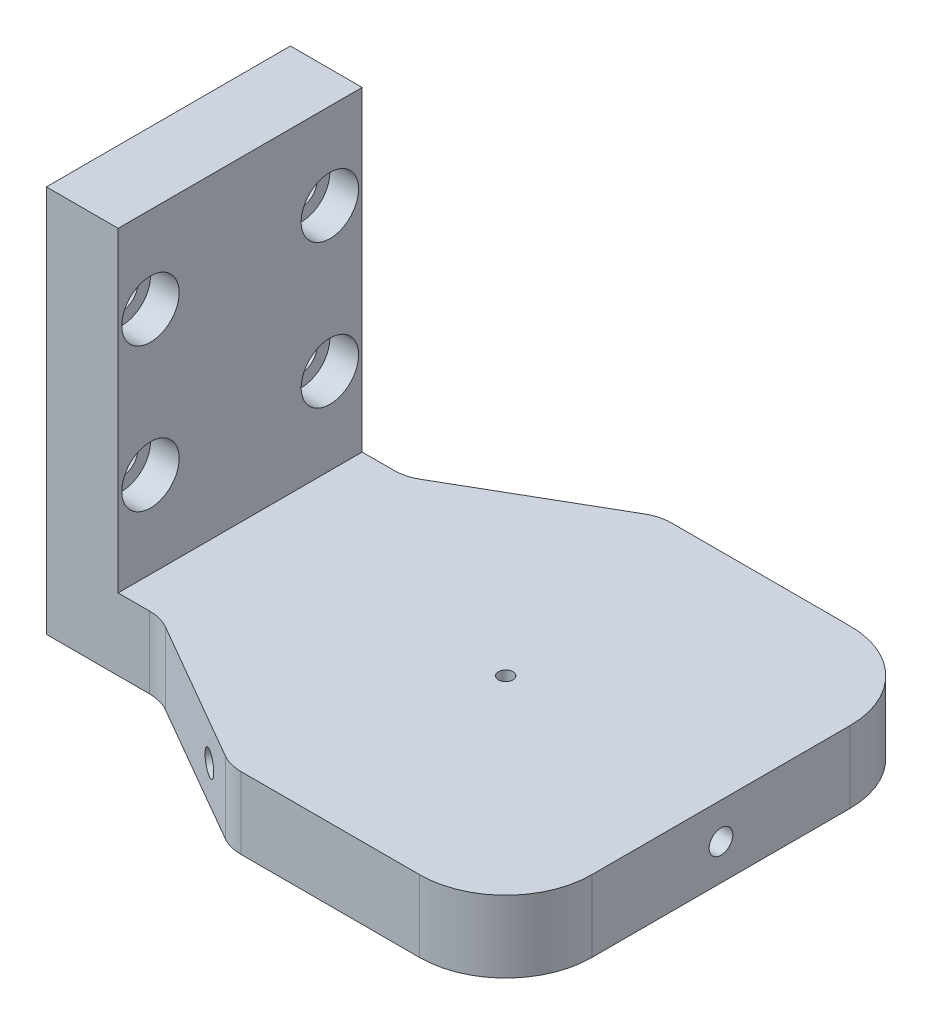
ISO-10303-21;
HEADER;
FILE_DESCRIPTION(('STEP AP214'),'2;1');
FILE_NAME('part.step','',(''),(''),'','','');
FILE_SCHEMA(('AUTOMOTIVE_DESIGN { 1 0 10303 214 1 1 1 1 }'));
ENDSEC;
DATA;
#1=APPLICATION_CONTEXT('core data for automotive mechanical design processes');
#2=APPLICATION_PROTOCOL_DEFINITION('international standard','automotive_design',2000,#1);
#3=PRODUCT_CONTEXT('',#1,'mechanical');
#4=PRODUCT('Part','Part','',(#3));
#5=PRODUCT_RELATED_PRODUCT_CATEGORY('part','',(#4));
#6=PRODUCT_DEFINITION_FORMATION('','',#4);
#7=PRODUCT_DEFINITION_CONTEXT('part definition',#1,'design');
#8=PRODUCT_DEFINITION('design','',#6,#7);
#9=PRODUCT_DEFINITION_SHAPE('','',#8);
#10=(LENGTH_UNIT() NAMED_UNIT(*) SI_UNIT(.MILLI.,.METRE.));
#11=(NAMED_UNIT(*) PLANE_ANGLE_UNIT() SI_UNIT($,.RADIAN.));
#12=(NAMED_UNIT(*) SI_UNIT($,.STERADIAN.) SOLID_ANGLE_UNIT());
#13=UNCERTAINTY_MEASURE_WITH_UNIT(LENGTH_MEASURE(1.E-05),#10,'distance_accuracy_value','');
#14=(GEOMETRIC_REPRESENTATION_CONTEXT(3) GLOBAL_UNCERTAINTY_ASSIGNED_CONTEXT((#13)) GLOBAL_UNIT_ASSIGNED_CONTEXT((#10,
#11,#12)) REPRESENTATION_CONTEXT('',''));
#15=CARTESIAN_POINT('',(0.,0.,0.));
#16=DIRECTION('',(0.,0.,1.));
#17=DIRECTION('',(1.,0.,0.));
#18=AXIS2_PLACEMENT_3D('',#15,#16,#17);
#19=CARTESIAN_POINT('',(30.,10.,30.));
#20=DIRECTION('',(-1.,0.,0.));
#21=DIRECTION('',(0.,0.,1.));
#22=AXIS2_PLACEMENT_3D('',#19,#20,#21);
#23=PLANE('',#22);
#24=DIRECTION('',(0.,0.,-1.));
#25=VECTOR('',#24,1.);
#26=CARTESIAN_POINT('',(30.,0.,30.));
#27=LINE('',#26,#25);
#28=CARTESIAN_POINT('',(30.,0.,18.));
#29=VERTEX_POINT('',#28);
#30=CARTESIAN_POINT('',(30.,0.,-18.));
#31=VERTEX_POINT('',#30);
#32=EDGE_CURVE('E240',#29,#31,#27,.T.);
#33=ORIENTED_EDGE('',*,*,#32,.T.);
#34=DIRECTION('',(0.,-1.,0.));
#35=VECTOR('',#34,1.);
#36=CARTESIAN_POINT('',(30.,10.,-18.));
#37=LINE('',#36,#35);
#38=CARTESIAN_POINT('',(30.,10.,-18.));
#39=VERTEX_POINT('',#38);
#40=EDGE_CURVE('E55',#31,#39,#37,.F.);
#41=ORIENTED_EDGE('',*,*,#40,.T.);
#42=DIRECTION('',(0.,0.,-1.));
#43=VECTOR('',#42,1.);
#44=CARTESIAN_POINT('',(30.,10.,30.));
#45=LINE('',#44,#43);
#46=CARTESIAN_POINT('',(30.,10.,18.));
#47=VERTEX_POINT('',#46);
#48=EDGE_CURVE('E249',#47,#39,#45,.T.);
#49=ORIENTED_EDGE('',*,*,#48,.F.);
#50=DIRECTION('',(0.,-1.,0.));
#51=VECTOR('',#50,1.);
#52=CARTESIAN_POINT('',(30.,10.,18.));
#53=LINE('',#52,#51);
#54=EDGE_CURVE('E439',#47,#29,#53,.T.);
#55=ORIENTED_EDGE('',*,*,#54,.T.);
#56=EDGE_LOOP('',(#33,#41,#49,#55));
#57=FACE_BOUND('',#56,.T.);
#58=CARTESIAN_POINT('',(30.,5.,0.));
#59=DIRECTION('',(1.,0.,0.));
#60=DIRECTION('',(0.,0.,-1.));
#61=AXIS2_PLACEMENT_3D('',#58,#59,#60);
#62=CIRCLE('',#61,1.64999999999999);
#63=CARTESIAN_POINT('',(30.,5.,-1.64999999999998));
#64=VERTEX_POINT('',#63);
#65=EDGE_CURVE('E187',#64,#64,#62,.T.);
#66=ORIENTED_EDGE('',*,*,#65,.F.);
#67=EDGE_LOOP('',(#66));
#68=FACE_BOUND('',#67,.T.);
#69=ADVANCED_FACE('F34',(#57,#68),#23,.F.);
#70=CARTESIAN_POINT('',(0.,10.,0.));
#71=DIRECTION('',(0.,-1.,0.));
#72=DIRECTION('',(0.,0.,-1.));
#73=AXIS2_PLACEMENT_3D('',#70,#71,#72);
#74=CYLINDRICAL_SURFACE('',#73,1.);
#75=CARTESIAN_POINT('',(-0.45262794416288,6.38829825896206,0.891699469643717));
#76=CARTESIAN_POINT('',(-0.410856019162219,6.37463429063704,0.912938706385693));
#77=CARTESIAN_POINT('',(-0.367149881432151,6.36210854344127,0.931392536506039));
#78=CARTESIAN_POINT('',(-0.276640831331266,6.34056914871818,0.962157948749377));
#79=CARTESIAN_POINT('',(-0.229827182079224,6.33156850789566,0.974446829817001));
#80=CARTESIAN_POINT('',(-0.133928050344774,6.31839711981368,0.992195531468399));
#81=CARTESIAN_POINT('',(-0.0848313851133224,6.31425350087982,0.99761700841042));
#82=CARTESIAN_POINT('',(0.0136494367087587,6.31159242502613,1.00111587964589));
#83=CARTESIAN_POINT('',(0.0630324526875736,6.31305974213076,0.999213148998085));
#84=CARTESIAN_POINT('',(0.156573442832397,6.32098907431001,0.988697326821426));
#85=CARTESIAN_POINT('',(0.200831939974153,6.3270393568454,0.980636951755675));
#86=CARTESIAN_POINT('',(0.287289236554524,6.34284121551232,0.958883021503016));
#87=CARTESIAN_POINT('',(0.329484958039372,6.35259814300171,0.945181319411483));
#88=CARTESIAN_POINT('',(0.414425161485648,6.37565979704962,0.911323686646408));
#89=CARTESIAN_POINT('',(0.456932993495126,6.38918920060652,0.890732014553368));
#90=CARTESIAN_POINT('',(0.538195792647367,6.41799467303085,0.844122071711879));
#91=CARTESIAN_POINT('',(0.576949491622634,6.43327132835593,0.818101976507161));
#92=CARTESIAN_POINT('',(0.657645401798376,6.46744933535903,0.755384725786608));
#93=CARTESIAN_POINT('',(0.698693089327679,6.48646816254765,0.717593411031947));
#94=CARTESIAN_POINT('',(0.774199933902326,6.52341785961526,0.635398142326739));
#95=CARTESIAN_POINT('',(0.808654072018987,6.54134789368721,0.590989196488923));
#96=CARTESIAN_POINT('',(0.871610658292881,6.57526689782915,0.493777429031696));
#97=CARTESIAN_POINT('',(0.899711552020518,6.59110688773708,0.440658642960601));
#98=CARTESIAN_POINT('',(0.946185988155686,6.61783962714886,0.329186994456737));
#99=CARTESIAN_POINT('',(0.964573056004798,6.62873925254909,0.27084154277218));
#100=CARTESIAN_POINT('',(0.988808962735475,6.64321720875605,0.15852734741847));
#101=CARTESIAN_POINT('',(0.995945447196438,6.64754483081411,0.104933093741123));
#102=CARTESIAN_POINT('',(1.00144808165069,6.65087614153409,-0.0028591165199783));
#103=CARTESIAN_POINT('',(0.999819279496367,6.6498828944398,-0.0570567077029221));
#104=CARTESIAN_POINT('',(0.988522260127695,6.64306431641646,-0.158644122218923));
#105=CARTESIAN_POINT('',(0.979689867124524,6.6377415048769,-0.206165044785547));
#106=CARTESIAN_POINT('',(0.955483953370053,6.62337758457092,-0.298911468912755));
#107=CARTESIAN_POINT('',(0.94010953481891,6.61433596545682,-0.344136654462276));
#108=CARTESIAN_POINT('',(0.902669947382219,6.59281788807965,-0.433145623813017));
#109=CARTESIAN_POINT('',(0.880354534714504,6.58021492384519,-0.47679260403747));
#110=CARTESIAN_POINT('',(0.830013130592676,6.55273217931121,-0.55985702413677));
#111=CARTESIAN_POINT('',(0.801984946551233,6.53785152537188,-0.599272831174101));
#112=CARTESIAN_POINT('',(0.736735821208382,6.50478688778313,-0.67837349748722));
#113=CARTESIAN_POINT('',(0.698785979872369,6.4864275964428,-0.717384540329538));
#114=CARTESIAN_POINT('',(0.617007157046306,6.44977940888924,-0.788832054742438));
#115=CARTESIAN_POINT('',(0.573169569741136,6.43149065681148,-0.821258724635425));
#116=CARTESIAN_POINT('',(0.476036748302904,6.395312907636,-0.881442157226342));
#117=CARTESIAN_POINT('',(0.422245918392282,6.37760684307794,-0.908519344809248));
#118=CARTESIAN_POINT('',(0.309454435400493,6.34734915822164,-0.952828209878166));
#119=CARTESIAN_POINT('',(0.250468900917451,6.3347831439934,-0.970087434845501));
#120=CARTESIAN_POINT('',(0.145657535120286,6.31977098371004,-0.990361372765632));
#121=CARTESIAN_POINT('',(0.100588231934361,6.31550682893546,-0.995966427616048));
#122=CARTESIAN_POINT('',(0.0099153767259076,6.31169910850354,-1.00097847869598));
#123=CARTESIAN_POINT('',(-0.0356877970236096,6.31215238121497,-1.00038962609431));
#124=CARTESIAN_POINT('',(-0.126025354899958,6.31770524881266,-0.9930618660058));
#125=CARTESIAN_POINT('',(-0.170760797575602,6.3227987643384,-0.986331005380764));
#126=CARTESIAN_POINT('',(-0.258344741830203,6.33692519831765,-0.967093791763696));
#127=CARTESIAN_POINT('',(-0.301191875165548,6.34596092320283,-0.954583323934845));
#128=CARTESIAN_POINT('',(-0.361616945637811,6.3612231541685,-0.932545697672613));
#129=CARTESIAN_POINT('',(-0.38027970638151,6.36630993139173,-0.925088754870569));
#130=CARTESIAN_POINT('',(-0.416940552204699,6.37696550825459,-0.909152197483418));
#131=CARTESIAN_POINT('',(-0.434940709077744,6.38253258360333,-0.90067620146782));
#132=CARTESIAN_POINT('',(-0.45262794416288,6.38829825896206,-0.891699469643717));
#133=B_SPLINE_CURVE_WITH_KNOTS('',3,(#75,#76,#77,#78,#79,#80,#81,#82,#83,#84,#85,#86,#87,#88,
#89,#90,#91,#92,#93,#94,#95,#96,#97,#98,#99,#100,#101,#102,#103,#104,#105,#106,#107,#108,#109,
#110,#111,#112,#113,#114,#115,#116,#117,#118,#119,#120,#121,#122,#123,#124,#125,#126,#127,#128,
#129,#130,#131,#132),.UNSPECIFIED.,.F.,.F.,(4,2,2,2,2,2,2,2,2,2,2,2,2,2,2,2,2,2,2,2,2,2,2,2,2,2,
2,2,4),(0.,0.146506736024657,0.293549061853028,0.441408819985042,0.58886762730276,
0.724451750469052,0.860232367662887,1.00710266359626,1.15402240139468,1.33011125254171,
1.50633361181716,1.69169924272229,1.87680608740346,2.03859551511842,2.20029177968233,
2.34551708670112,2.49076233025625,2.64200994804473,2.79331572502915,2.96492759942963,
3.13679309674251,3.32407126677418,3.5108213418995,3.64705311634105,3.78319359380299,
3.91915596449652,4.05521528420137,4.1173757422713,4.17932165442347),.UNSPECIFIED.);
#134=CARTESIAN_POINT('',(0.5,6.4044571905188,0.86602540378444));
#135=VERTEX_POINT('',#134);
#136=CARTESIAN_POINT('',(0.50000000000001,6.40445719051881,-0.866025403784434));
#137=VERTEX_POINT('',#136);
#138=EDGE_CURVE('E177',#135,#137,#133,.T.);
#139=ORIENTED_EDGE('',*,*,#138,.F.);
#140=CARTESIAN_POINT('',(-0.545920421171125,6.38829825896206,-0.83783703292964));
#141=CARTESIAN_POINT('',(-0.585200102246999,6.37463429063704,-0.812281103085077));
#142=CARTESIAN_POINT('',(-0.623034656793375,6.36210854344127,-0.78365739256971));
#143=CARTESIAN_POINT('',(-0.694932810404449,6.34056914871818,-0.720656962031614));
#144=CARTESIAN_POINT('',(-0.72898211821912,6.33156850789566,-0.686259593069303));
#145=CARTESIAN_POINT('',(-0.792302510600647,6.31839711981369,-0.612082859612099));
#146=CARTESIAN_POINT('',(-0.821545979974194,6.31425350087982,-0.572274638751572));
#147=CARTESIAN_POINT('',(-0.873816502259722,6.31159242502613,-0.488737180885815));
#148=CARTESIAN_POINT('',(-0.896860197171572,6.31305974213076,-0.445018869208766));
#149=CARTESIAN_POINT('',(-0.934523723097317,6.32098907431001,-0.35875208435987));
#150=CARTESIAN_POINT('',(-0.949672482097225,6.3270393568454,-0.316392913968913));
#151=CARTESIAN_POINT('',(-0.974061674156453,6.34284121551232,-0.230641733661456));
#152=CARTESIAN_POINT('',(-0.983293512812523,6.35259814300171,-0.1872483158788));
#153=CARTESIAN_POINT('',(-0.996442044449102,6.37565979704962,-0.0967591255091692));
#154=CARTESIAN_POINT('',(-0.99986304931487,6.38918920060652,-0.0496504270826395));
#155=CARTESIAN_POINT('',(-1.00012905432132,6.41799467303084,0.0440301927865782));
#156=CARTESIAN_POINT('',(-0.996971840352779,6.43327132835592,0.0906019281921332));
#157=CARTESIAN_POINT('',(-0.983005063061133,6.46744933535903,0.191845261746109));
#158=CARTESIAN_POINT('',(-0.970800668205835,6.48646816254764,0.246289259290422));
#159=CARTESIAN_POINT('',(-0.937370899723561,6.52341785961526,0.352777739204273));
#160=CARTESIAN_POINT('',(-0.916138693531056,6.54134789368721,0.404820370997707));
#161=CARTESIAN_POINT('',(-0.86342912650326,6.57526689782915,0.50794825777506));
#162=CARTESIAN_POINT('',(-0.831477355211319,6.59110688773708,0.558843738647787));
#163=CARTESIAN_POINT('',(-0.758177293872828,6.61783962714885,0.654827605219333));
#164=CARTESIAN_POINT('',(-0.716842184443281,6.62873925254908,0.699923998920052));
#165=CARTESIAN_POINT('',(-0.631693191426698,6.64321720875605,0.777070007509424));
#166=CARTESIAN_POINT('',(-0.58884744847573,6.64754483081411,0.810047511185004));
#167=CARTESIAN_POINT('',(-0.498247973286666,6.65087614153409,0.868709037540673));
#168=CARTESIAN_POINT('',(-0.450497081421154,6.6498828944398,0.894397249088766));
#169=CARTESIAN_POINT('',(-0.356871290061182,6.64306431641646,0.935407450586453));
#170=CARTESIAN_POINT('',(-0.311300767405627,6.6377415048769,0.951518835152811));
#171=CARTESIAN_POINT('',(-0.218877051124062,6.62337758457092,0.976929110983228));
#172=CARTESIAN_POINT('',(-0.172023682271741,6.61433596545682,0.986227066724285));
#173=CARTESIAN_POINT('',(-0.076219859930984,6.59281788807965,0.998307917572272));
#174=CARTESIAN_POINT('',(-0.0272627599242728,6.58021492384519,1.00080569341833));
#175=CARTESIAN_POINT('',(0.0698438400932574,6.55273217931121,0.998740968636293));
#176=CARTESIAN_POINT('',(0.117993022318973,6.53785152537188,0.994175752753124));
#177=CARTESIAN_POINT('',(0.219120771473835,6.50478688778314,0.97721868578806));
#178=CARTESIAN_POINT('',(0.271880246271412,6.4864275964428,0.963858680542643));
#179=CARTESIAN_POINT('',(0.374645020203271,6.44977940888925,0.928759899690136));
#180=CARTESIAN_POINT('',(0.424646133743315,6.43149065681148,0.907008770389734));
#181=CARTESIAN_POINT('',(0.525332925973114,6.39531290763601,0.852980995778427));
#182=CARTESIAN_POINT('',(0.575677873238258,6.37760684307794,0.819935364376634));
#183=CARTESIAN_POINT('',(0.670446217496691,6.34734915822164,0.744409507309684));
#184=CARTESIAN_POINT('',(0.714885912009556,6.3347831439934,0.701956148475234));
#185=CARTESIAN_POINT('',(0.784849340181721,6.31977098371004,0.621323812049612));
#186=CARTESIAN_POINT('',(0.812238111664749,6.31550682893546,0.585095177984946));
#187=CARTESIAN_POINT('',(0.861915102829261,6.31169910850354,0.509076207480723));
#188=CARTESIAN_POINT('',(0.884206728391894,6.31215238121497,0.469288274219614));
#189=CARTESIAN_POINT('',(0.923029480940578,6.31770524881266,0.387389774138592));
#190=CARTESIAN_POINT('',(0.939568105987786,6.3227987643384,0.345282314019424));
#191=CARTESIAN_POINT('',(0.966700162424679,6.33692519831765,0.259813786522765));
#192=CARTESIAN_POINT('',(0.977289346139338,6.34596092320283,0.216451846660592));
#193=CARTESIAN_POINT('',(0.98841673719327,6.3612231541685,0.15310338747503));
#194=CARTESIAN_POINT('',(0.991290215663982,6.36630993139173,0.133212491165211));
#195=CARTESIAN_POINT('',(0.995819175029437,6.37696550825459,0.0934949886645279));
#196=CARTESIAN_POINT('',(0.997478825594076,6.38253258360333,0.0736683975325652));
#197=CARTESIAN_POINT('',(0.99854836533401,6.38829825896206,0.0538624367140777));
#198=B_SPLINE_CURVE_WITH_KNOTS('',3,(#140,#141,#142,#143,#144,#145,#146,#147,#148,#149,#150,
#151,#152,#153,#154,#155,#156,#157,#158,#159,#160,#161,#162,#163,#164,#165,#166,#167,#168,#169,
#170,#171,#172,#173,#174,#175,#176,#177,#178,#179,#180,#181,#182,#183,#184,#185,#186,#187,#188,
#189,#190,#191,#192,#193,#194,#195,#196,#197),.UNSPECIFIED.,.F.,.F.,(4,2,2,2,2,2,2,2,2,2,2,2,2,
2,2,2,2,2,2,2,2,2,2,2,2,2,2,2,4),(0.,0.146506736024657,0.293549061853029,0.441408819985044,
0.588867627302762,0.724451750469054,0.860232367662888,1.00710266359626,1.15402240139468,
1.33011125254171,1.50633361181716,1.69169924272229,1.87680608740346,2.03859551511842,
2.20029177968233,2.34551708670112,2.49076233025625,2.64200994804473,2.79331572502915,
2.96492759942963,3.13679309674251,3.32407126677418,3.5108213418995,3.64705311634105,
3.78319359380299,3.91915596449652,4.05521528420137,4.1173757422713,4.17932165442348),.UNSPECIFIED.);
#199=CARTESIAN_POINT('',(-1.,6.40445719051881,0.));
#200=VERTEX_POINT('',#199);
#201=EDGE_CURVE('E178',#200,#135,#198,.T.);
#202=ORIENTED_EDGE('',*,*,#201,.F.);
#203=CARTESIAN_POINT('',(0.866025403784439,6.31244047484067,-0.500000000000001));
#204=CARTESIAN_POINT('',(0.853409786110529,6.31243258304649,-0.521856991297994));
#205=CARTESIAN_POINT('',(0.839969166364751,6.31316922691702,-0.543218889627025));
#206=CARTESIAN_POINT('',(0.811578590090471,6.3160574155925,-0.584783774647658));
#207=CARTESIAN_POINT('',(0.79663015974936,6.31820754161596,-0.60498790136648));
#208=CARTESIAN_POINT('',(0.749974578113,6.32661869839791,-0.663323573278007));
#209=CARTESIAN_POINT('',(0.716225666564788,6.33484321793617,-0.699576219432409));
#210=CARTESIAN_POINT('',(0.644630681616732,6.35527529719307,-0.766053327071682));
#211=CARTESIAN_POINT('',(0.606799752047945,6.36746845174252,-0.796298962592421));
#212=CARTESIAN_POINT('',(0.527752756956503,6.39442929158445,-0.8507561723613));
#213=CARTESIAN_POINT('',(0.486528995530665,6.40920292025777,-0.87495349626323));
#214=CARTESIAN_POINT('',(0.396148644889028,6.44185747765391,-0.919737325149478));
#215=CARTESIAN_POINT('',(0.34664253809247,6.45989648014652,-0.939502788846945));
#216=CARTESIAN_POINT('',(0.24504887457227,6.49577387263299,-0.97096869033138));
#217=CARTESIAN_POINT('',(0.19296038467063,6.51361218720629,-0.982666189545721));
#218=CARTESIAN_POINT('',(0.0810916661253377,6.5494364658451,-0.998477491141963));
#219=CARTESIAN_POINT('',(0.0211000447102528,6.5672184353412,-1.00160378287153));
#220=CARTESIAN_POINT('',(-0.0995449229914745,6.59864466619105,-0.99685722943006));
#221=CARTESIAN_POINT('',(-0.160197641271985,6.61229255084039,-0.988994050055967));
#222=CARTESIAN_POINT('',(-0.274211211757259,6.63272322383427,-0.963267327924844));
#223=CARTESIAN_POINT('',(-0.327708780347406,6.64004343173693,-0.946447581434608));
#224=CARTESIAN_POINT('',(-0.431500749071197,6.64908431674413,-0.903849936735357));
#225=CARTESIAN_POINT('',(-0.481798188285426,6.65081038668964,-0.87808069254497));
#226=CARTESIAN_POINT('',(-0.571170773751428,6.64861993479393,-0.822303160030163));
#227=CARTESIAN_POINT('',(-0.610860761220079,6.64538925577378,-0.793242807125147));
#228=CARTESIAN_POINT('',(-0.685243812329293,6.63482071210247,-0.729948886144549));
#229=CARTESIAN_POINT('',(-0.719936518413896,6.62748255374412,-0.695714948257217));
#230=CARTESIAN_POINT('',(-0.783765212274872,6.60928527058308,-0.622951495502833));
#231=CARTESIAN_POINT('',(-0.812872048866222,6.59840843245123,-0.584401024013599));
#232=CARTESIAN_POINT('',(-0.864943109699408,6.57399780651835,-0.504146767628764));
#233=CARTESIAN_POINT('',(-0.887905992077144,6.56046343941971,-0.462442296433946));
#234=CARTESIAN_POINT('',(-0.929927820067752,6.52995299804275,-0.371531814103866));
#235=CARTESIAN_POINT('',(-0.948182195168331,6.51275870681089,-0.322027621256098));
#236=CARTESIAN_POINT('',(-0.976703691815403,6.47764845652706,-0.220940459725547));
#237=CARTESIAN_POINT('',(-0.986957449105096,6.45973134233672,-0.169354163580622));
#238=CARTESIAN_POINT('',(-1.00001904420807,6.42266920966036,-0.0586032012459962));
#239=CARTESIAN_POINT('',(-1.00178336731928,6.40363557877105,0.000726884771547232));
#240=CARTESIAN_POINT('',(-0.994589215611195,6.36928423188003,0.119674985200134));
#241=CARTESIAN_POINT('',(-0.985669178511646,6.35395343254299,0.179291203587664));
#242=CARTESIAN_POINT('',(-0.960146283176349,6.33255258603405,0.283319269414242));
#243=CARTESIAN_POINT('',(-0.945842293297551,6.3251527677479,0.328010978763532));
#244=CARTESIAN_POINT('',(-0.919554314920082,6.3176025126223,0.393679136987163));
#245=CARTESIAN_POINT('',(-0.909939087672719,6.31567685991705,0.415422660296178));
#246=CARTESIAN_POINT('',(-0.889142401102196,6.3130919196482,0.458251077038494));
#247=CARTESIAN_POINT('',(-0.877959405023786,6.31243388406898,0.479335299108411));
#248=CARTESIAN_POINT('',(-0.866025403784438,6.31244047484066,0.500000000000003));
#249=B_SPLINE_CURVE_WITH_KNOTS('',3,(#203,#204,#205,#206,#207,#208,#209,#210,#211,#212,#213,
#214,#215,#216,#217,#218,#219,#220,#221,#222,#223,#224,#225,#226,#227,#228,#229,#230,#231,#232,
#233,#234,#235,#236,#237,#238,#239,#240,#241,#242,#243,#244,#245,#246,#247,#248),.UNSPECIFIED.,
.F.,.F.,(4,2,2,2,2,2,2,2,2,2,2,2,2,2,2,2,2,2,2,2,2,2,4),(0.,0.0756504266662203,
0.151225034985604,0.301014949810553,0.4502671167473,0.599867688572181,0.768038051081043,
0.936269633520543,1.1232012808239,1.30996861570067,1.47862314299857,1.64711503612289,
1.79430319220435,1.94150187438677,2.089449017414,2.23742844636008,2.40325067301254,
2.5693493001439,2.75541915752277,2.94082162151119,3.08264207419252,3.1541139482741,
3.225656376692),.UNSPECIFIED.);
#250=EDGE_CURVE('E192',#137,#200,#249,.T.);
#251=ORIENTED_EDGE('',*,*,#250,.F.);
#252=EDGE_LOOP('',(#139,#202,#251));
#253=FACE_BOUND('',#252,.T.);
#254=CARTESIAN_POINT('',(0.,10.,0.));
#255=DIRECTION('',(0.,1.,0.));
#256=DIRECTION('',(0.,0.,1.));
#257=AXIS2_PLACEMENT_3D('',#254,#255,#256);
#258=CIRCLE('',#257,1.);
#259=CARTESIAN_POINT('',(0.,10.,1.));
#260=VERTEX_POINT('',#259);
#261=EDGE_CURVE('E247',#260,#260,#258,.T.);
#262=ORIENTED_EDGE('',*,*,#261,.T.);
#263=EDGE_LOOP('',(#262));
#264=FACE_BOUND('',#263,.T.);
#265=ADVANCED_FACE('F484',(#253,#264),#74,.F.);
#266=CARTESIAN_POINT('',(-31.,0.,-17.));
#267=DIRECTION('',(0.500000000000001,0.,0.866025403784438));
#268=DIRECTION('',(0.866025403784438,0.,-0.500000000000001));
#269=AXIS2_PLACEMENT_3D('',#266,#267,#268);
#270=PLANE('',#269);
#271=DIRECTION('',(0.866025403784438,0.,-0.500000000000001));
#272=VECTOR('',#271,1.);
#273=CARTESIAN_POINT('',(-31.,10.,-17.));
#274=LINE('',#273,#272);
#275=CARTESIAN_POINT('',(-29.6076951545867,10.,-17.8038475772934));
#276=VERTEX_POINT('',#275);
#277=CARTESIAN_POINT('',(-9.87564434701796,10.,-29.1961524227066));
#278=VERTEX_POINT('',#277);
#279=EDGE_CURVE('E272',#276,#278,#274,.T.);
#280=ORIENTED_EDGE('',*,*,#279,.T.);
#281=DIRECTION('',(0.,1.,0.));
#282=VECTOR('',#281,1.);
#283=CARTESIAN_POINT('',(-9.87564434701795,0.,-29.1961524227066));
#284=LINE('',#283,#282);
#285=CARTESIAN_POINT('',(-9.87564434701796,0.,-29.1961524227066));
#286=VERTEX_POINT('',#285);
#287=EDGE_CURVE('E420',#278,#286,#284,.F.);
#288=ORIENTED_EDGE('',*,*,#287,.T.);
#289=DIRECTION('',(0.866025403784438,0.,-0.500000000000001));
#290=VECTOR('',#289,1.);
#291=CARTESIAN_POINT('',(-31.,0.,-17.));
#292=LINE('',#291,#290);
#293=CARTESIAN_POINT('',(-29.6076951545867,0.,-17.8038475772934));
#294=VERTEX_POINT('',#293);
#295=EDGE_CURVE('E264',#294,#286,#292,.T.);
#296=ORIENTED_EDGE('',*,*,#295,.F.);
#297=DIRECTION('',(0.,1.,0.));
#298=VECTOR('',#297,1.);
#299=CARTESIAN_POINT('',(-29.6076951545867,10.,-17.8038475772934));
#300=LINE('',#299,#298);
#301=EDGE_CURVE('E401',#294,#276,#300,.T.);
#302=ORIENTED_EDGE('',*,*,#301,.T.);
#303=EDGE_LOOP('',(#280,#288,#296,#302));
#304=FACE_BOUND('',#303,.T.);
#305=CARTESIAN_POINT('',(-15.1112159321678,5.,-26.1733937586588));
#306=DIRECTION('',(-0.500000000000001,0.,-0.866025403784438));
#307=DIRECTION('',(-0.866025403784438,0.,0.500000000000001));
#308=AXIS2_PLACEMENT_3D('',#305,#306,#307);
#309=CIRCLE('',#308,1.65);
#310=CARTESIAN_POINT('',(-16.5401578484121,5.,-25.3483937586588));
#311=VERTEX_POINT('',#310);
#312=EDGE_CURVE('E289',#311,#311,#309,.T.);
#313=ORIENTED_EDGE('',*,*,#312,.F.);
#314=EDGE_LOOP('',(#313));
#315=FACE_BOUND('',#314,.T.);
#316=ADVANCED_FACE('F489',(#304,#315),#270,.F.);
#317=CARTESIAN_POINT('',(0.,10.,0.));
#318=DIRECTION('',(0.,1.,0.));
#319=DIRECTION('',(0.,0.,1.));
#320=AXIS2_PLACEMENT_3D('',#317,#318,#319);
#321=PLANE('',#320);
#322=ORIENTED_EDGE('',*,*,#48,.T.);
#323=CARTESIAN_POINT('',(18.,10.,-18.));
#324=DIRECTION('',(0.,1.,0.));
#325=DIRECTION('',(0.,0.,1.));
#326=AXIS2_PLACEMENT_3D('',#323,#324,#325);
#327=CIRCLE('',#326,12.);
#328=CARTESIAN_POINT('',(18.,10.,-30.));
#329=VERTEX_POINT('',#328);
#330=EDGE_CURVE('E42',#39,#329,#327,.T.);
#331=ORIENTED_EDGE('',*,*,#330,.T.);
#332=DIRECTION('',(-1.,0.,0.));
#333=VECTOR('',#332,1.);
#334=CARTESIAN_POINT('',(30.,10.,-30.));
#335=LINE('',#334,#333);
#336=CARTESIAN_POINT('',(-6.87564434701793,10.,-30.));
#337=VERTEX_POINT('',#336);
#338=EDGE_CURVE('E223',#329,#337,#335,.T.);
#339=ORIENTED_EDGE('',*,*,#338,.T.);
#340=CARTESIAN_POINT('',(-6.87564434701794,10.,-24.));
#341=DIRECTION('',(0.,1.,0.));
#342=DIRECTION('',(0.,0.,1.));
#343=AXIS2_PLACEMENT_3D('',#340,#341,#342);
#344=CIRCLE('',#343,6.);
#345=EDGE_CURVE('E418',#337,#278,#344,.T.);
#346=ORIENTED_EDGE('',*,*,#345,.T.);
#347=ORIENTED_EDGE('',*,*,#279,.F.);
#348=CARTESIAN_POINT('',(-32.6076951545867,10.,-23.));
#349=DIRECTION('',(0.,1.,0.));
#350=DIRECTION('',(0.,0.,1.));
#351=AXIS2_PLACEMENT_3D('',#348,#349,#350);
#352=CIRCLE('',#351,6.);
#353=CARTESIAN_POINT('',(-32.6076951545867,10.,-17.));
#354=VERTEX_POINT('',#353);
#355=EDGE_CURVE('E409',#276,#354,#352,.F.);
#356=ORIENTED_EDGE('',*,*,#355,.T.);
#357=DIRECTION('',(1.,0.,0.));
#358=VECTOR('',#357,1.);
#359=CARTESIAN_POINT('',(-47.,10.,-17.));
#360=LINE('',#359,#358);
#361=CARTESIAN_POINT('',(-37.,10.,-17.));
#362=VERTEX_POINT('',#361);
#363=EDGE_CURVE('E276',#362,#354,#360,.T.);
#364=ORIENTED_EDGE('',*,*,#363,.F.);
#365=DIRECTION('',(0.,0.,-1.));
#366=VECTOR('',#365,1.);
#367=CARTESIAN_POINT('',(-37.,10.,17.));
#368=LINE('',#367,#366);
#369=CARTESIAN_POINT('',(-37.,10.,17.));
#370=VERTEX_POINT('',#369);
#371=EDGE_CURVE('E260',#370,#362,#368,.T.);
#372=ORIENTED_EDGE('',*,*,#371,.F.);
#373=DIRECTION('',(-1.,0.,0.));
#374=VECTOR('',#373,1.);
#375=CARTESIAN_POINT('',(-47.,10.,17.));
#376=LINE('',#375,#374);
#377=CARTESIAN_POINT('',(-32.6076951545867,10.,17.));
#378=VERTEX_POINT('',#377);
#379=EDGE_CURVE('E284',#378,#370,#376,.T.);
#380=ORIENTED_EDGE('',*,*,#379,.F.);
#381=CARTESIAN_POINT('',(-32.6076951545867,10.,23.));
#382=DIRECTION('',(0.,1.,0.));
#383=DIRECTION('',(0.,0.,1.));
#384=AXIS2_PLACEMENT_3D('',#381,#382,#383);
#385=CIRCLE('',#384,6.);
#386=CARTESIAN_POINT('',(-29.6076951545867,10.,17.8038475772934));
#387=VERTEX_POINT('',#386);
#388=EDGE_CURVE('E389',#378,#387,#385,.F.);
#389=ORIENTED_EDGE('',*,*,#388,.T.);
#390=DIRECTION('',(-0.866025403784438,0.,-0.500000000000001));
#391=VECTOR('',#390,1.);
#392=CARTESIAN_POINT('',(-31.,10.,17.));
#393=LINE('',#392,#391);
#394=CARTESIAN_POINT('',(-9.87564434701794,10.,29.1961524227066));
#395=VERTEX_POINT('',#394);
#396=EDGE_CURVE('E287',#395,#387,#393,.T.);
#397=ORIENTED_EDGE('',*,*,#396,.F.);
#398=CARTESIAN_POINT('',(-6.87564434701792,10.,24.));
#399=DIRECTION('',(0.,1.,0.));
#400=DIRECTION('',(0.,0.,1.));
#401=AXIS2_PLACEMENT_3D('',#398,#399,#400);
#402=CIRCLE('',#401,6.);
#403=CARTESIAN_POINT('',(-6.87564434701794,10.,30.));
#404=VERTEX_POINT('',#403);
#405=EDGE_CURVE('E416',#395,#404,#402,.T.);
#406=ORIENTED_EDGE('',*,*,#405,.T.);
#407=DIRECTION('',(1.,0.,0.));
#408=VECTOR('',#407,1.);
#409=CARTESIAN_POINT('',(-47.,10.,30.));
#410=LINE('',#409,#408);
#411=CARTESIAN_POINT('',(18.,10.,30.));
#412=VERTEX_POINT('',#411);
#413=EDGE_CURVE('E239',#404,#412,#410,.T.);
#414=ORIENTED_EDGE('',*,*,#413,.T.);
#415=CARTESIAN_POINT('',(18.,10.,18.));
#416=DIRECTION('',(0.,1.,0.));
#417=DIRECTION('',(0.,0.,1.));
#418=AXIS2_PLACEMENT_3D('',#415,#416,#417);
#419=CIRCLE('',#418,12.);
#420=EDGE_CURVE('E443',#412,#47,#419,.T.);
#421=ORIENTED_EDGE('',*,*,#420,.T.);
#422=EDGE_LOOP('',(#322,#331,#339,#346,#347,#356,#364,#372,#380,#389,#397,#406,#414,#421));
#423=FACE_BOUND('',#422,.T.);
#424=ORIENTED_EDGE('',*,*,#261,.F.);
#425=EDGE_LOOP('',(#424));
#426=FACE_BOUND('',#425,.T.);
#427=ADVANCED_FACE('F386',(#423,#426),#321,.T.);
#428=CARTESIAN_POINT('',(0.,0.,0.));
#429=DIRECTION('',(0.,1.,0.));
#430=DIRECTION('',(0.,0.,1.));
#431=AXIS2_PLACEMENT_3D('',#428,#429,#430);
#432=PLANE('',#431);
#433=DIRECTION('',(-1.,0.,0.));
#434=VECTOR('',#433,1.);
#435=CARTESIAN_POINT('',(30.,0.,-30.));
#436=LINE('',#435,#434);
#437=CARTESIAN_POINT('',(18.,0.,-30.));
#438=VERTEX_POINT('',#437);
#439=CARTESIAN_POINT('',(-6.87564434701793,0.,-30.));
#440=VERTEX_POINT('',#439);
#441=EDGE_CURVE('E237',#438,#440,#436,.T.);
#442=ORIENTED_EDGE('',*,*,#441,.F.);
#443=CARTESIAN_POINT('',(18.,0.,-18.));
#444=DIRECTION('',(0.,1.,0.));
#445=DIRECTION('',(0.,0.,1.));
#446=AXIS2_PLACEMENT_3D('',#443,#444,#445);
#447=CIRCLE('',#446,12.);
#448=EDGE_CURVE('E437',#438,#31,#447,.F.);
#449=ORIENTED_EDGE('',*,*,#448,.T.);
#450=ORIENTED_EDGE('',*,*,#32,.F.);
#451=CARTESIAN_POINT('',(18.,0.,18.));
#452=DIRECTION('',(0.,1.,0.));
#453=DIRECTION('',(0.,0.,1.));
#454=AXIS2_PLACEMENT_3D('',#451,#452,#453);
#455=CIRCLE('',#454,12.);
#456=CARTESIAN_POINT('',(18.,0.,30.));
#457=VERTEX_POINT('',#456);
#458=EDGE_CURVE('E435',#29,#457,#455,.F.);
#459=ORIENTED_EDGE('',*,*,#458,.T.);
#460=DIRECTION('',(1.,0.,0.));
#461=VECTOR('',#460,1.);
#462=CARTESIAN_POINT('',(-47.,0.,30.));
#463=LINE('',#462,#461);
#464=CARTESIAN_POINT('',(-6.87564434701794,0.,30.));
#465=VERTEX_POINT('',#464);
#466=EDGE_CURVE('E242',#465,#457,#463,.T.);
#467=ORIENTED_EDGE('',*,*,#466,.F.);
#468=CARTESIAN_POINT('',(-6.87564434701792,0.,24.));
#469=DIRECTION('',(0.,1.,0.));
#470=DIRECTION('',(0.,0.,1.));
#471=AXIS2_PLACEMENT_3D('',#468,#469,#470);
#472=CIRCLE('',#471,6.);
#473=CARTESIAN_POINT('',(-9.87564434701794,0.,29.1961524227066));
#474=VERTEX_POINT('',#473);
#475=EDGE_CURVE('E422',#465,#474,#472,.F.);
#476=ORIENTED_EDGE('',*,*,#475,.T.);
#477=DIRECTION('',(-0.866025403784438,0.,-0.500000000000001));
#478=VECTOR('',#477,1.);
#479=CARTESIAN_POINT('',(-31.,0.,17.));
#480=LINE('',#479,#478);
#481=CARTESIAN_POINT('',(-29.6076951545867,0.,17.8038475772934));
#482=VERTEX_POINT('',#481);
#483=EDGE_CURVE('E286',#474,#482,#480,.T.);
#484=ORIENTED_EDGE('',*,*,#483,.T.);
#485=CARTESIAN_POINT('',(-32.6076951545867,0.,23.));
#486=DIRECTION('',(0.,1.,0.));
#487=DIRECTION('',(0.,0.,1.));
#488=AXIS2_PLACEMENT_3D('',#485,#486,#487);
#489=CIRCLE('',#488,6.);
#490=CARTESIAN_POINT('',(-32.6076951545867,0.,17.));
#491=VERTEX_POINT('',#490);
#492=EDGE_CURVE('E392',#482,#491,#489,.T.);
#493=ORIENTED_EDGE('',*,*,#492,.T.);
#494=DIRECTION('',(-1.,0.,0.));
#495=VECTOR('',#494,1.);
#496=CARTESIAN_POINT('',(-47.,0.,17.));
#497=LINE('',#496,#495);
#498=CARTESIAN_POINT('',(-47.,0.,17.));
#499=VERTEX_POINT('',#498);
#500=EDGE_CURVE('E279',#491,#499,#497,.T.);
#501=ORIENTED_EDGE('',*,*,#500,.T.);
#502=DIRECTION('',(0.,0.,1.));
#503=VECTOR('',#502,1.);
#504=CARTESIAN_POINT('',(-47.,0.,-30.));
#505=LINE('',#504,#503);
#506=CARTESIAN_POINT('',(-47.,0.,-17.));
#507=VERTEX_POINT('',#506);
#508=EDGE_CURVE('E244',#507,#499,#505,.T.);
#509=ORIENTED_EDGE('',*,*,#508,.F.);
#510=DIRECTION('',(1.,0.,0.));
#511=VECTOR('',#510,1.);
#512=CARTESIAN_POINT('',(-47.,0.,-17.));
#513=LINE('',#512,#511);
#514=CARTESIAN_POINT('',(-32.6076951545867,0.,-17.));
#515=VERTEX_POINT('',#514);
#516=EDGE_CURVE('E275',#507,#515,#513,.T.);
#517=ORIENTED_EDGE('',*,*,#516,.T.);
#518=CARTESIAN_POINT('',(-32.6076951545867,0.,-23.));
#519=DIRECTION('',(0.,1.,0.));
#520=DIRECTION('',(0.,0.,1.));
#521=AXIS2_PLACEMENT_3D('',#518,#519,#520);
#522=CIRCLE('',#521,6.);
#523=EDGE_CURVE('E411',#515,#294,#522,.T.);
#524=ORIENTED_EDGE('',*,*,#523,.T.);
#525=ORIENTED_EDGE('',*,*,#295,.T.);
#526=CARTESIAN_POINT('',(-6.87564434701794,0.,-24.));
#527=DIRECTION('',(0.,1.,0.));
#528=DIRECTION('',(0.,0.,1.));
#529=AXIS2_PLACEMENT_3D('',#526,#527,#528);
#530=CIRCLE('',#529,6.);
#531=EDGE_CURVE('E424',#286,#440,#530,.F.);
#532=ORIENTED_EDGE('',*,*,#531,.T.);
#533=EDGE_LOOP('',(#442,#449,#450,#459,#467,#476,#484,#493,#501,#509,#517,#524,#525,#532));
#534=FACE_BOUND('',#533,.T.);
#535=CARTESIAN_POINT('',(0.,0.,0.));
#536=DIRECTION('',(0.,1.,0.));
#537=DIRECTION('',(0.,0.,1.));
#538=AXIS2_PLACEMENT_3D('',#535,#536,#537);
#539=CIRCLE('',#538,1.);
#540=CARTESIAN_POINT('',(0.,0.,1.));
#541=VERTEX_POINT('',#540);
#542=EDGE_CURVE('E235',#541,#541,#539,.T.);
#543=ORIENTED_EDGE('',*,*,#542,.T.);
#544=EDGE_LOOP('',(#543));
#545=FACE_BOUND('',#544,.T.);
#546=ADVANCED_FACE('F456',(#534,#545),#432,.F.);
#547=CARTESIAN_POINT('',(-47.,10.,-30.));
#548=DIRECTION('',(1.,0.,0.));
#549=DIRECTION('',(0.,0.,-1.));
#550=AXIS2_PLACEMENT_3D('',#547,#548,#549);
#551=PLANE('',#550);
#552=CARTESIAN_POINT('',(-47.,42.,12.5));
#553=DIRECTION('',(1.,0.,0.));
#554=DIRECTION('',(0.,0.,-1.));
#555=AXIS2_PLACEMENT_3D('',#552,#553,#554);
#556=CIRCLE('',#555,2.25);
#557=CARTESIAN_POINT('',(-47.,42.,10.25));
#558=VERTEX_POINT('',#557);
#559=EDGE_CURVE('E338',#558,#558,#556,.T.);
#560=ORIENTED_EDGE('',*,*,#559,.T.);
#561=EDGE_LOOP('',(#560));
#562=FACE_BOUND('',#561,.T.);
#563=CARTESIAN_POINT('',(-47.,42.,-12.5));
#564=DIRECTION('',(1.,0.,0.));
#565=DIRECTION('',(0.,0.,-1.));
#566=AXIS2_PLACEMENT_3D('',#563,#564,#565);
#567=CIRCLE('',#566,2.25);
#568=CARTESIAN_POINT('',(-47.,42.,-14.75));
#569=VERTEX_POINT('',#568);
#570=EDGE_CURVE('E326',#569,#569,#567,.T.);
#571=ORIENTED_EDGE('',*,*,#570,.T.);
#572=EDGE_LOOP('',(#571));
#573=FACE_BOUND('',#572,.T.);
#574=CARTESIAN_POINT('',(-47.,22.,-12.5));
#575=DIRECTION('',(1.,0.,0.));
#576=DIRECTION('',(0.,0.,-1.));
#577=AXIS2_PLACEMENT_3D('',#574,#575,#576);
#578=CIRCLE('',#577,2.25);
#579=CARTESIAN_POINT('',(-47.,22.,-14.75));
#580=VERTEX_POINT('',#579);
#581=EDGE_CURVE('E314',#580,#580,#578,.T.);
#582=ORIENTED_EDGE('',*,*,#581,.T.);
#583=EDGE_LOOP('',(#582));
#584=FACE_BOUND('',#583,.T.);
#585=CARTESIAN_POINT('',(-47.,22.,12.5));
#586=DIRECTION('',(1.,0.,0.));
#587=DIRECTION('',(0.,0.,-1.));
#588=AXIS2_PLACEMENT_3D('',#585,#586,#587);
#589=CIRCLE('',#588,2.25);
#590=CARTESIAN_POINT('',(-47.,22.,10.25));
#591=VERTEX_POINT('',#590);
#592=EDGE_CURVE('E302',#591,#591,#589,.T.);
#593=ORIENTED_EDGE('',*,*,#592,.T.);
#594=EDGE_LOOP('',(#593));
#595=FACE_BOUND('',#594,.T.);
#596=ORIENTED_EDGE('',*,*,#508,.T.);
#597=DIRECTION('',(0.,-1.,0.));
#598=VECTOR('',#597,1.);
#599=CARTESIAN_POINT('',(-47.,54.,17.));
#600=LINE('',#599,#598);
#601=CARTESIAN_POINT('',(-47.,54.,17.));
#602=VERTEX_POINT('',#601);
#603=EDGE_CURVE('E232',#602,#499,#600,.T.);
#604=ORIENTED_EDGE('',*,*,#603,.F.);
#605=DIRECTION('',(0.,0.,1.));
#606=VECTOR('',#605,1.);
#607=CARTESIAN_POINT('',(-47.,54.,17.));
#608=LINE('',#607,#606);
#609=CARTESIAN_POINT('',(-47.,54.,-17.));
#610=VERTEX_POINT('',#609);
#611=EDGE_CURVE('E263',#610,#602,#608,.T.);
#612=ORIENTED_EDGE('',*,*,#611,.F.);
#613=DIRECTION('',(0.,-1.,0.));
#614=VECTOR('',#613,1.);
#615=CARTESIAN_POINT('',(-47.,54.,-17.));
#616=LINE('',#615,#614);
#617=EDGE_CURVE('E226',#610,#507,#616,.T.);
#618=ORIENTED_EDGE('',*,*,#617,.T.);
#619=EDGE_LOOP('',(#596,#604,#612,#618));
#620=FACE_BOUND('',#619,.T.);
#621=ADVANCED_FACE('F216',(#562,#573,#584,#595,#620),#551,.F.);
#622=CARTESIAN_POINT('',(-47.,10.,30.));
#623=DIRECTION('',(0.,0.,-1.));
#624=DIRECTION('',(-1.,0.,0.));
#625=AXIS2_PLACEMENT_3D('',#622,#623,#624);
#626=PLANE('',#625);
#627=ORIENTED_EDGE('',*,*,#466,.T.);
#628=DIRECTION('',(0.,-1.,0.));
#629=VECTOR('',#628,1.);
#630=CARTESIAN_POINT('',(18.,10.,30.));
#631=LINE('',#630,#629);
#632=EDGE_CURVE('E11',#457,#412,#631,.F.);
#633=ORIENTED_EDGE('',*,*,#632,.T.);
#634=ORIENTED_EDGE('',*,*,#413,.F.);
#635=DIRECTION('',(0.,1.,0.));
#636=VECTOR('',#635,1.);
#637=CARTESIAN_POINT('',(-6.87564434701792,10.,30.));
#638=LINE('',#637,#636);
#639=EDGE_CURVE('E430',#404,#465,#638,.F.);
#640=ORIENTED_EDGE('',*,*,#639,.T.);
#641=EDGE_LOOP('',(#627,#633,#634,#640));
#642=FACE_BOUND('',#641,.T.);
#643=ADVANCED_FACE('F464',(#642),#626,.F.);
#644=CARTESIAN_POINT('',(30.,10.,-30.));
#645=DIRECTION('',(0.,0.,1.));
#646=DIRECTION('',(1.,0.,0.));
#647=AXIS2_PLACEMENT_3D('',#644,#645,#646);
#648=PLANE('',#647);
#649=ORIENTED_EDGE('',*,*,#338,.F.);
#650=DIRECTION('',(0.,-1.,0.));
#651=VECTOR('',#650,1.);
#652=CARTESIAN_POINT('',(18.,10.,-30.));
#653=LINE('',#652,#651);
#654=EDGE_CURVE('E432',#329,#438,#653,.T.);
#655=ORIENTED_EDGE('',*,*,#654,.T.);
#656=ORIENTED_EDGE('',*,*,#441,.T.);
#657=DIRECTION('',(0.,1.,0.));
#658=VECTOR('',#657,1.);
#659=CARTESIAN_POINT('',(-6.87564434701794,10.,-30.));
#660=LINE('',#659,#658);
#661=EDGE_CURVE('E413',#440,#337,#660,.T.);
#662=ORIENTED_EDGE('',*,*,#661,.T.);
#663=EDGE_LOOP('',(#649,#655,#656,#662));
#664=FACE_BOUND('',#663,.T.);
#665=ADVANCED_FACE('F450',(#664),#648,.F.);
#666=CARTESIAN_POINT('',(-0.45262794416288,3.61170174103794,-0.891699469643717));
#667=CARTESIAN_POINT('',(-0.410856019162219,3.62536570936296,-0.912938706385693));
#668=CARTESIAN_POINT('',(-0.367149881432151,3.63789145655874,-0.931392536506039));
#669=CARTESIAN_POINT('',(-0.276640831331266,3.65943085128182,-0.962157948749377));
#670=CARTESIAN_POINT('',(-0.229827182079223,3.66843149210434,-0.974446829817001));
#671=CARTESIAN_POINT('',(-0.133928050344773,3.68160288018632,-0.992195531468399));
#672=CARTESIAN_POINT('',(-0.0848313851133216,3.68574649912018,-0.99761700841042));
#673=CARTESIAN_POINT('',(0.0136494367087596,3.68840757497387,-1.00111587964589));
#674=CARTESIAN_POINT('',(0.0630324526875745,3.68694025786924,-0.999213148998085));
#675=CARTESIAN_POINT('',(0.156573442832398,3.67901092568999,-0.988697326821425));
#676=CARTESIAN_POINT('',(0.200831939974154,3.6729606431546,-0.980636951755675));
#677=CARTESIAN_POINT('',(0.287289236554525,3.65715878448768,-0.958883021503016));
#678=CARTESIAN_POINT('',(0.329484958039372,3.64740185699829,-0.945181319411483));
#679=CARTESIAN_POINT('',(0.414425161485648,3.62434020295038,-0.911323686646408));
#680=CARTESIAN_POINT('',(0.456932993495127,3.61081079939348,-0.890732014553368));
#681=CARTESIAN_POINT('',(0.538195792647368,3.58200532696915,-0.844122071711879));
#682=CARTESIAN_POINT('',(0.576949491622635,3.56672867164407,-0.818101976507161));
#683=CARTESIAN_POINT('',(0.657645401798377,3.53255066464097,-0.755384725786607));
#684=CARTESIAN_POINT('',(0.69869308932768,3.51353183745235,-0.717593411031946));
#685=CARTESIAN_POINT('',(0.774199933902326,3.47658214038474,-0.635398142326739));
#686=CARTESIAN_POINT('',(0.808654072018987,3.45865210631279,-0.590989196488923));
#687=CARTESIAN_POINT('',(0.871610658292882,3.42473310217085,-0.493777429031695));
#688=CARTESIAN_POINT('',(0.899711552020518,3.40889311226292,-0.440658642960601));
#689=CARTESIAN_POINT('',(0.946185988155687,3.38216037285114,-0.329186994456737));
#690=CARTESIAN_POINT('',(0.964573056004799,3.37126074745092,-0.27084154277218));
#691=CARTESIAN_POINT('',(0.988808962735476,3.35678279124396,-0.158527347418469));
#692=CARTESIAN_POINT('',(0.995945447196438,3.35245516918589,-0.104933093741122));
#693=CARTESIAN_POINT('',(1.00144808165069,3.34912385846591,0.00285911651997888));
#694=CARTESIAN_POINT('',(0.999819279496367,3.3501171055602,0.0570567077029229));
#695=CARTESIAN_POINT('',(0.988522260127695,3.35693568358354,0.158644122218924));
#696=CARTESIAN_POINT('',(0.979689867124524,3.3622584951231,0.206165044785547));
#697=CARTESIAN_POINT('',(0.955483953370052,3.37662241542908,0.298911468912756));
#698=CARTESIAN_POINT('',(0.94010953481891,3.38566403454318,0.344136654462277));
#699=CARTESIAN_POINT('',(0.902669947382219,3.40718211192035,0.433145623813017));
#700=CARTESIAN_POINT('',(0.880354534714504,3.41978507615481,0.476792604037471));
#701=CARTESIAN_POINT('',(0.830013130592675,3.44726782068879,0.55985702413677));
#702=CARTESIAN_POINT('',(0.801984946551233,3.46214847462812,0.599272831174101));
#703=CARTESIAN_POINT('',(0.736735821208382,3.49521311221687,0.67837349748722));
#704=CARTESIAN_POINT('',(0.698785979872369,3.5135724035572,0.717384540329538));
#705=CARTESIAN_POINT('',(0.617007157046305,3.55022059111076,0.788832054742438));
#706=CARTESIAN_POINT('',(0.573169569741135,3.56850934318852,0.821258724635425));
#707=CARTESIAN_POINT('',(0.476036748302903,3.604687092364,0.881442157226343));
#708=CARTESIAN_POINT('',(0.422245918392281,3.62239315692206,0.908519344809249));
#709=CARTESIAN_POINT('',(0.309454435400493,3.65265084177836,0.952828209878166));
#710=CARTESIAN_POINT('',(0.25046890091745,3.6652168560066,0.970087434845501));
#711=CARTESIAN_POINT('',(0.145657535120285,3.68022901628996,0.990361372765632));
#712=CARTESIAN_POINT('',(0.10058823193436,3.68449317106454,0.995966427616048));
#713=CARTESIAN_POINT('',(0.0099153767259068,3.68830089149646,1.00097847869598));
#714=CARTESIAN_POINT('',(-0.0356877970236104,3.68784761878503,1.00038962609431));
#715=CARTESIAN_POINT('',(-0.126025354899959,3.68229475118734,0.9930618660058));
#716=CARTESIAN_POINT('',(-0.170760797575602,3.6772012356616,0.986331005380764));
#717=CARTESIAN_POINT('',(-0.258344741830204,3.66307480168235,0.967093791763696));
#718=CARTESIAN_POINT('',(-0.301191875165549,3.65403907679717,0.954583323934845));
#719=CARTESIAN_POINT('',(-0.361616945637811,3.6387768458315,0.932545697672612));
#720=CARTESIAN_POINT('',(-0.380279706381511,3.63369006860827,0.925088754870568));
#721=CARTESIAN_POINT('',(-0.4169405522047,3.62303449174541,0.909152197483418));
#722=CARTESIAN_POINT('',(-0.434940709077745,3.61746741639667,0.90067620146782));
#723=CARTESIAN_POINT('',(-0.452627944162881,3.61170174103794,0.891699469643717));
#724=B_SPLINE_CURVE_WITH_KNOTS('',3,(#666,#667,#668,#669,#670,#671,#672,#673,#674,#675,#676,
#677,#678,#679,#680,#681,#682,#683,#684,#685,#686,#687,#688,#689,#690,#691,#692,#693,#694,#695,
#696,#697,#698,#699,#700,#701,#702,#703,#704,#705,#706,#707,#708,#709,#710,#711,#712,#713,#714,
#715,#716,#717,#718,#719,#720,#721,#722,#723),.UNSPECIFIED.,.F.,.F.,(4,2,2,2,2,2,2,2,2,2,2,2,2,
2,2,2,2,2,2,2,2,2,2,2,2,2,2,2,4),(0.,0.146506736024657,0.293549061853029,0.441408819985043,
0.588867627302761,0.724451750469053,0.860232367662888,1.00710266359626,1.15402240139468,
1.33011125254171,1.50633361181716,1.69169924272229,1.87680608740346,2.03859551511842,
2.20029177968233,2.34551708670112,2.49076233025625,2.64200994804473,2.79331572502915,
2.96492759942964,3.13679309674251,3.32407126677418,3.5108213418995,3.64705311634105,
3.78319359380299,3.91915596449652,4.05521528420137,4.1173757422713,4.17932165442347),.UNSPECIFIED.);
#725=CARTESIAN_POINT('',(0.500000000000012,3.59554280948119,-0.866025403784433));
#726=VERTEX_POINT('',#725);
#727=CARTESIAN_POINT('',(0.499999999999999,3.5955428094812,0.86602540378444));
#728=VERTEX_POINT('',#727);
#729=EDGE_CURVE('E166',#726,#728,#724,.T.);
#730=ORIENTED_EDGE('',*,*,#729,.F.);
#731=CARTESIAN_POINT('',(-0.866025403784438,3.68755952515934,0.500000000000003));
#732=CARTESIAN_POINT('',(-0.878646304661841,3.68756741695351,0.478146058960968));
#733=CARTESIAN_POINT('',(-0.890425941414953,3.68683077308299,0.455825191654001));
#734=CARTESIAN_POINT('',(-0.912226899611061,3.68394258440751,0.410455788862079));
#735=CARTESIAN_POINT('',(-0.922249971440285,3.68179245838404,0.387408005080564));
#736=CARTESIAN_POINT('',(-0.949442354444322,3.67338130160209,0.317835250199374));
#737=CARTESIAN_POINT('',(-0.963963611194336,3.66515678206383,0.270481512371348));
#738=CARTESIAN_POINT('',(-0.985736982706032,3.64472470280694,0.17523988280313));
#739=CARTESIAN_POINT('',(-0.993015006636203,3.63253154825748,0.127354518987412));
#740=CARTESIAN_POINT('',(-1.00065283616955,3.60557070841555,0.0316692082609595));
#741=CARTESIAN_POINT('',(-1.0009964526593,3.59079707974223,-0.0161302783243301));
#742=CARTESIAN_POINT('',(-0.99459021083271,3.55814252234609,-0.116793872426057));
#743=CARTESIAN_POINT('',(-0.986954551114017,3.54010351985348,-0.169550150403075));
#744=CARTESIAN_POINT('',(-0.963407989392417,3.50422612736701,-0.273265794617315));
#745=CARTESIAN_POINT('',(-0.947494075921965,3.48638781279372,-0.324224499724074));
#746=CARTESIAN_POINT('',(-0.905252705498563,3.4505635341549,-0.42901130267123));
#747=CARTESIAN_POINT('',(-0.877964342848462,3.4327815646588,-0.482528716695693));
#748=CARTESIAN_POINT('',(-0.813531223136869,3.40135533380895,-0.58463704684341));
#749=CARTESIAN_POINT('',(-0.776395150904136,3.38770744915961,-0.633232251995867));
#750=CARTESIAN_POINT('',(-0.697108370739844,3.36727677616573,-0.71910753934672));
#751=CARTESIAN_POINT('',(-0.655793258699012,3.35995656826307,-0.757027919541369));
#752=CARTESIAN_POINT('',(-0.567006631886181,3.35091568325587,-0.825615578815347));
#753=CARTESIAN_POINT('',(-0.519541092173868,3.34918961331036,-0.85628981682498));
#754=CARTESIAN_POINT('',(-0.426550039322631,3.35138006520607,-0.90579997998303));
#755=CARTESIAN_POINT('',(-0.381538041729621,3.35461074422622,-0.925642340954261));
#756=CARTESIAN_POINT('',(-0.289532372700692,3.36517928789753,-0.958412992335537));
#757=CARTESIAN_POINT('',(-0.242538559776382,3.37251744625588,-0.971340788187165));
#758=CARTESIAN_POINT('',(-0.147609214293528,3.39071472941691,-0.990236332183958));
#759=CARTESIAN_POINT('',(-0.0996701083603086,3.40159156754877,-0.996168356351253));
#760=CARTESIAN_POINT('',(-0.00413235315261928,3.42600219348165,-1.00113608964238));
#761=CARTESIAN_POINT('',(0.0434662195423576,3.43953656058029,-1.0001702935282));
#762=CARTESIAN_POINT('',(0.143207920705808,3.47004700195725,-0.991107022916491));
#763=CARTESIAN_POINT('',(0.195206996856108,3.48724129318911,-0.982163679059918));
#764=CARTESIAN_POINT('',(0.297011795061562,3.52235154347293,-0.95632043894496));
#765=CARTESIAN_POINT('',(0.346813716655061,3.54026865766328,-0.939407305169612));
#766=CARTESIAN_POINT('',(0.449257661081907,3.57733079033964,-0.89534349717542));
#767=CARTESIAN_POINT('',(0.501521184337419,3.59636442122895,-0.867206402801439));
#768=CARTESIAN_POINT('',(0.600936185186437,3.63071576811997,-0.801502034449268));
#769=CARTESIAN_POINT('',(0.648105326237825,3.646046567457,-0.763968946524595));
#770=CARTESIAN_POINT('',(0.725434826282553,3.66744741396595,-0.689851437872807));
#771=CARTESIAN_POINT('',(0.75698698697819,3.6748472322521,-0.655117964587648));
#772=CARTESIAN_POINT('',(0.800713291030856,3.6823974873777,-0.599517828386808));
#773=CARTESIAN_POINT('',(0.814736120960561,3.68432314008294,-0.580319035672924));
#774=CARTESIAN_POINT('',(0.841428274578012,3.6869080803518,-0.54089436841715));
#775=CARTESIAN_POINT('',(0.854096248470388,3.68756611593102,-0.520667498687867));
#776=CARTESIAN_POINT('',(0.866025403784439,3.68755952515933,-0.500000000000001));
#777=B_SPLINE_CURVE_WITH_KNOTS('',3,(#731,#732,#733,#734,#735,#736,#737,#738,#739,#740,#741,
#742,#743,#744,#745,#746,#747,#748,#749,#750,#751,#752,#753,#754,#755,#756,#757,#758,#759,#760,
#761,#762,#763,#764,#765,#766,#767,#768,#769,#770,#771,#772,#773,#774,#775,#776),.UNSPECIFIED.,
.F.,.F.,(4,2,2,2,2,2,2,2,2,2,2,2,2,2,2,2,2,2,2,2,2,2,4),(0.,0.0756504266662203,
0.151225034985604,0.301014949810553,0.4502671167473,0.599867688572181,0.768038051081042,
0.936269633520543,1.1232012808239,1.30996861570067,1.47862314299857,1.64711503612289,
1.79430319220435,1.94150187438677,2.089449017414,2.23742844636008,2.40325067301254,
2.5693493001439,2.75541915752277,2.94082162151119,3.08264207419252,3.1541139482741,
3.225656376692),.UNSPECIFIED.);
#778=CARTESIAN_POINT('',(-1.,3.59554280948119,0.));
#779=VERTEX_POINT('',#778);
#780=EDGE_CURVE('E191',#779,#726,#777,.T.);
#781=ORIENTED_EDGE('',*,*,#780,.F.);
#782=CARTESIAN_POINT('',(0.99854836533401,3.61170174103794,0.053862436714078));
#783=CARTESIAN_POINT('',(0.996056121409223,3.62536570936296,0.100657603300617));
#784=CARTESIAN_POINT('',(0.990184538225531,3.63789145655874,0.14773514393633));
#785=CARTESIAN_POINT('',(0.971573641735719,3.65943085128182,0.241500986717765));
#786=CARTESIAN_POINT('',(0.958809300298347,3.66843149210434,0.288187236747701));
#787=CARTESIAN_POINT('',(0.926230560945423,3.68160288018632,0.380112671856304));
#788=CARTESIAN_POINT('',(0.906377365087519,3.68574649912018,0.425342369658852));
#789=CARTESIAN_POINT('',(0.860167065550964,3.68840757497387,0.512378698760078));
#790=CARTESIAN_POINT('',(0.833827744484,3.68694025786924,0.554194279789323));
#791=CARTESIAN_POINT('',(0.777950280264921,3.67901092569,0.62994524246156));
#792=CARTESIAN_POINT('',(0.748840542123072,3.6729606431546,0.664244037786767));
#793=CARTESIAN_POINT('',(0.686772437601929,3.65715878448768,0.728241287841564));
#794=CARTESIAN_POINT('',(0.653808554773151,3.64740185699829,0.757933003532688));
#795=CARTESIAN_POINT('',(0.582016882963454,3.62434020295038,0.814564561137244));
#796=CARTESIAN_POINT('',(0.542930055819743,3.61081079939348,0.841081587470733));
#797=CARTESIAN_POINT('',(0.461933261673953,3.58200532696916,0.888152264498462));
#798=CARTESIAN_POINT('',(0.420022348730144,3.56672867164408,0.908703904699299));
#799=CARTESIAN_POINT('',(0.325359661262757,3.53255066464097,0.947229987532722));
#800=CARTESIAN_POINT('',(0.272107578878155,3.51353183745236,0.963882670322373));
#801=CARTESIAN_POINT('',(0.163170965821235,3.47658214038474,0.988175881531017));
#802=CARTESIAN_POINT('',(0.107484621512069,3.4586521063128,0.995809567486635));
#803=CARTESIAN_POINT('',(-0.00818153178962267,3.42473310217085,1.00172568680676));
#804=CARTESIAN_POINT('',(-0.0682341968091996,3.40889311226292,0.999502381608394));
#805=CARTESIAN_POINT('',(-0.18800869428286,3.38216037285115,0.984014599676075));
#806=CARTESIAN_POINT('',(-0.24773087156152,3.37126074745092,0.970765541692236));
#807=CARTESIAN_POINT('',(-0.35711577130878,3.35678279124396,0.935597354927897));
#808=CARTESIAN_POINT('',(-0.407097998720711,3.35245516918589,0.91498060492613));
#809=CARTESIAN_POINT('',(-0.503200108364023,3.34912385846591,0.865849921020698));
#810=CARTESIAN_POINT('',(-0.549322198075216,3.3501171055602,0.837340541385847));
#811=CARTESIAN_POINT('',(-0.631650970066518,3.35693568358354,0.776763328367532));
#812=CARTESIAN_POINT('',(-0.668389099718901,3.3622584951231,0.745353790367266));
#813=CARTESIAN_POINT('',(-0.736606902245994,3.37662241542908,0.678017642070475));
#814=CARTESIAN_POINT('',(-0.768085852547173,3.38566403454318,0.64209041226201));
#815=CARTESIAN_POINT('',(-0.826450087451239,3.40718211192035,0.565162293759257));
#816=CARTESIAN_POINT('',(-0.853091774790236,3.41978507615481,0.524013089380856));
#817=CARTESIAN_POINT('',(-0.899856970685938,3.44726782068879,0.438883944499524));
#818=CARTESIAN_POINT('',(-0.919977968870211,3.46214847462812,0.394902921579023));
#819=CARTESIAN_POINT('',(-0.955856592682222,3.49521311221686,0.29884518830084));
#820=CARTESIAN_POINT('',(-0.970666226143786,3.5135724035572,0.246474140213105));
#821=CARTESIAN_POINT('',(-0.991652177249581,3.55022059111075,0.139927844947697));
#822=CARTESIAN_POINT('',(-0.997815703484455,3.56850934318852,0.0857500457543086));
#823=CARTESIAN_POINT('',(-1.00136967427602,3.604687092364,-0.0284611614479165));
#824=CARTESIAN_POINT('',(-0.997923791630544,3.62239315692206,-0.088583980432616));
#825=CARTESIAN_POINT('',(-0.979900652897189,3.65265084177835,-0.208418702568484));
#826=CARTESIAN_POINT('',(-0.965354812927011,3.6652168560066,-0.268131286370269));
#827=CARTESIAN_POINT('',(-0.930506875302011,3.68022901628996,-0.369037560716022));
#828=CARTESIAN_POINT('',(-0.912826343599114,3.68449317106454,-0.410871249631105));
#829=CARTESIAN_POINT('',(-0.871830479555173,3.68830089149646,-0.491902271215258));
#830=CARTESIAN_POINT('',(-0.848518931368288,3.68784761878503,-0.531101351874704));
#831=CARTESIAN_POINT('',(-0.797004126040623,3.68229475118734,-0.605672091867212));
#832=CARTESIAN_POINT('',(-0.768807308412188,3.6772012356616,-0.641048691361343));
#833=CARTESIAN_POINT('',(-0.708355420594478,3.66307480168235,-0.707280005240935));
#834=CARTESIAN_POINT('',(-0.676097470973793,3.65403907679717,-0.738131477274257));
#835=CARTESIAN_POINT('',(-0.62679979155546,3.6387768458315,-0.779442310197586));
#836=CARTESIAN_POINT('',(-0.611010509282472,3.63369006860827,-0.79187626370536));
#837=CARTESIAN_POINT('',(-0.578878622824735,3.62303449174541,-0.815657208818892));
#838=CARTESIAN_POINT('',(-0.562538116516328,3.61746741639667,-0.827007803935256));
#839=CARTESIAN_POINT('',(-0.545920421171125,3.61170174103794,-0.83783703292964));
#840=B_SPLINE_CURVE_WITH_KNOTS('',3,(#782,#783,#784,#785,#786,#787,#788,#789,#790,#791,#792,
#793,#794,#795,#796,#797,#798,#799,#800,#801,#802,#803,#804,#805,#806,#807,#808,#809,#810,#811,
#812,#813,#814,#815,#816,#817,#818,#819,#820,#821,#822,#823,#824,#825,#826,#827,#828,#829,#830,
#831,#832,#833,#834,#835,#836,#837,#838,#839),.UNSPECIFIED.,.F.,.F.,(4,2,2,2,2,2,2,2,2,2,2,2,2,
2,2,2,2,2,2,2,2,2,2,2,2,2,2,2,4),(0.,0.146506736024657,0.29354906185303,0.441408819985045,
0.588867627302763,0.724451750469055,0.86023236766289,1.00710266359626,1.15402240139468,
1.33011125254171,1.50633361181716,1.69169924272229,1.87680608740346,2.03859551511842,
2.20029177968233,2.34551708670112,2.49076233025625,2.64200994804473,2.79331572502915,
2.96492759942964,3.13679309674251,3.32407126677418,3.5108213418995,3.64705311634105,
3.78319359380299,3.91915596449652,4.05521528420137,4.1173757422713,4.17932165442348),.UNSPECIFIED.);
#841=EDGE_CURVE('E184',#728,#779,#840,.T.);
#842=ORIENTED_EDGE('',*,*,#841,.F.);
#843=EDGE_LOOP('',(#730,#781,#842));
#844=FACE_BOUND('',#843,.T.);
#845=ORIENTED_EDGE('',*,*,#542,.F.);
#846=EDGE_LOOP('',(#845));
#847=FACE_BOUND('',#846,.T.);
#848=ADVANCED_FACE('F189',(#844,#847),#74,.F.);
#849=CARTESIAN_POINT('',(-47.,54.,17.));
#850=DIRECTION('',(0.,0.,-1.));
#851=DIRECTION('',(-1.,0.,0.));
#852=AXIS2_PLACEMENT_3D('',#849,#850,#851);
#853=PLANE('',#852);
#854=ORIENTED_EDGE('',*,*,#500,.F.);
#855=DIRECTION('',(0.,1.,0.));
#856=VECTOR('',#855,1.);
#857=CARTESIAN_POINT('',(-32.6076951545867,10.,17.));
#858=LINE('',#857,#856);
#859=EDGE_CURVE('E384',#491,#378,#858,.T.);
#860=ORIENTED_EDGE('',*,*,#859,.T.);
#861=ORIENTED_EDGE('',*,*,#379,.T.);
#862=DIRECTION('',(0.,-1.,0.));
#863=VECTOR('',#862,1.);
#864=CARTESIAN_POINT('',(-37.,54.,17.));
#865=LINE('',#864,#863);
#866=CARTESIAN_POINT('',(-37.,54.,17.));
#867=VERTEX_POINT('',#866);
#868=EDGE_CURVE('E236',#867,#370,#865,.T.);
#869=ORIENTED_EDGE('',*,*,#868,.F.);
#870=DIRECTION('',(1.,0.,0.));
#871=VECTOR('',#870,1.);
#872=CARTESIAN_POINT('',(-47.,54.,17.));
#873=LINE('',#872,#871);
#874=EDGE_CURVE('E268',#602,#867,#873,.T.);
#875=ORIENTED_EDGE('',*,*,#874,.F.);
#876=ORIENTED_EDGE('',*,*,#603,.T.);
#877=EDGE_LOOP('',(#854,#860,#861,#869,#875,#876));
#878=FACE_BOUND('',#877,.T.);
#879=ADVANCED_FACE('F357',(#878),#853,.F.);
#880=CARTESIAN_POINT('',(-37.,54.,17.));
#881=DIRECTION('',(-1.,0.,0.));
#882=DIRECTION('',(0.,0.,1.));
#883=AXIS2_PLACEMENT_3D('',#880,#881,#882);
#884=PLANE('',#883);
#885=CARTESIAN_POINT('',(-37.,42.,12.5));
#886=DIRECTION('',(1.,0.,0.));
#887=DIRECTION('',(0.,0.,-1.));
#888=AXIS2_PLACEMENT_3D('',#885,#886,#887);
#889=CIRCLE('',#888,4.);
#890=CARTESIAN_POINT('',(-37.,42.,8.50000000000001));
#891=VERTEX_POINT('',#890);
#892=EDGE_CURVE('E347',#891,#891,#889,.T.);
#893=ORIENTED_EDGE('',*,*,#892,.F.);
#894=EDGE_LOOP('',(#893));
#895=FACE_BOUND('',#894,.T.);
#896=CARTESIAN_POINT('',(-37.,42.,-12.5));
#897=DIRECTION('',(1.,0.,0.));
#898=DIRECTION('',(0.,0.,-1.));
#899=AXIS2_PLACEMENT_3D('',#896,#897,#898);
#900=CIRCLE('',#899,4.);
#901=CARTESIAN_POINT('',(-37.,42.,-16.5));
#902=VERTEX_POINT('',#901);
#903=EDGE_CURVE('E335',#902,#902,#900,.T.);
#904=ORIENTED_EDGE('',*,*,#903,.F.);
#905=EDGE_LOOP('',(#904));
#906=FACE_BOUND('',#905,.T.);
#907=CARTESIAN_POINT('',(-37.,22.,-12.5));
#908=DIRECTION('',(1.,0.,0.));
#909=DIRECTION('',(0.,0.,-1.));
#910=AXIS2_PLACEMENT_3D('',#907,#908,#909);
#911=CIRCLE('',#910,4.);
#912=CARTESIAN_POINT('',(-37.,22.,-16.5));
#913=VERTEX_POINT('',#912);
#914=EDGE_CURVE('E323',#913,#913,#911,.T.);
#915=ORIENTED_EDGE('',*,*,#914,.F.);
#916=EDGE_LOOP('',(#915));
#917=FACE_BOUND('',#916,.T.);
#918=CARTESIAN_POINT('',(-37.,22.,12.5));
#919=DIRECTION('',(1.,0.,0.));
#920=DIRECTION('',(0.,0.,-1.));
#921=AXIS2_PLACEMENT_3D('',#918,#919,#920);
#922=CIRCLE('',#921,4.);
#923=CARTESIAN_POINT('',(-37.,22.,8.5));
#924=VERTEX_POINT('',#923);
#925=EDGE_CURVE('E311',#924,#924,#922,.T.);
#926=ORIENTED_EDGE('',*,*,#925,.F.);
#927=EDGE_LOOP('',(#926));
#928=FACE_BOUND('',#927,.T.);
#929=ORIENTED_EDGE('',*,*,#371,.T.);
#930=DIRECTION('',(0.,-1.,0.));
#931=VECTOR('',#930,1.);
#932=CARTESIAN_POINT('',(-37.,54.,-17.));
#933=LINE('',#932,#931);
#934=CARTESIAN_POINT('',(-37.,54.,-17.));
#935=VERTEX_POINT('',#934);
#936=EDGE_CURVE('E228',#935,#362,#933,.T.);
#937=ORIENTED_EDGE('',*,*,#936,.F.);
#938=DIRECTION('',(0.,0.,-1.));
#939=VECTOR('',#938,1.);
#940=CARTESIAN_POINT('',(-37.,54.,17.));
#941=LINE('',#940,#939);
#942=EDGE_CURVE('E266',#867,#935,#941,.T.);
#943=ORIENTED_EDGE('',*,*,#942,.F.);
#944=ORIENTED_EDGE('',*,*,#868,.T.);
#945=EDGE_LOOP('',(#929,#937,#943,#944));
#946=FACE_BOUND('',#945,.T.);
#947=ADVANCED_FACE('F353',(#895,#906,#917,#928,#946),#884,.F.);
#948=CARTESIAN_POINT('',(-47.,54.,-17.));
#949=DIRECTION('',(0.,0.,1.));
#950=DIRECTION('',(1.,0.,0.));
#951=AXIS2_PLACEMENT_3D('',#948,#949,#950);
#952=PLANE('',#951);
#953=ORIENTED_EDGE('',*,*,#363,.T.);
#954=DIRECTION('',(0.,1.,0.));
#955=VECTOR('',#954,1.);
#956=CARTESIAN_POINT('',(-32.6076951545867,0.,-17.));
#957=LINE('',#956,#955);
#958=EDGE_CURVE('E393',#354,#515,#957,.F.);
#959=ORIENTED_EDGE('',*,*,#958,.T.);
#960=ORIENTED_EDGE('',*,*,#516,.F.);
#961=ORIENTED_EDGE('',*,*,#617,.F.);
#962=DIRECTION('',(-1.,0.,0.));
#963=VECTOR('',#962,1.);
#964=CARTESIAN_POINT('',(-47.,54.,-17.));
#965=LINE('',#964,#963);
#966=EDGE_CURVE('E229',#935,#610,#965,.T.);
#967=ORIENTED_EDGE('',*,*,#966,.F.);
#968=ORIENTED_EDGE('',*,*,#936,.T.);
#969=EDGE_LOOP('',(#953,#959,#960,#961,#967,#968));
#970=FACE_BOUND('',#969,.T.);
#971=ADVANCED_FACE('F356',(#970),#952,.F.);
#972=CARTESIAN_POINT('',(0.,54.,0.));
#973=DIRECTION('',(0.,-1.,0.));
#974=DIRECTION('',(0.,0.,-1.));
#975=AXIS2_PLACEMENT_3D('',#972,#973,#974);
#976=PLANE('',#975);
#977=ORIENTED_EDGE('',*,*,#611,.T.);
#978=ORIENTED_EDGE('',*,*,#874,.T.);
#979=ORIENTED_EDGE('',*,*,#942,.T.);
#980=ORIENTED_EDGE('',*,*,#966,.T.);
#981=EDGE_LOOP('',(#977,#978,#979,#980));
#982=FACE_BOUND('',#981,.T.);
#983=ADVANCED_FACE('F378',(#982),#976,.F.);
#984=CARTESIAN_POINT('',(-31.,0.,17.));
#985=DIRECTION('',(0.500000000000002,0.,-0.866025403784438));
#986=DIRECTION('',(-0.866025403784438,0.,-0.500000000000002));
#987=AXIS2_PLACEMENT_3D('',#984,#985,#986);
#988=PLANE('',#987);
#989=CARTESIAN_POINT('',(-15.1112159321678,5.,26.1733937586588));
#990=DIRECTION('',(-0.500000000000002,0.,0.866025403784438));
#991=DIRECTION('',(0.866025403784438,0.,0.500000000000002));
#992=AXIS2_PLACEMENT_3D('',#989,#990,#991);
#993=CIRCLE('',#992,1.64999999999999);
#994=CARTESIAN_POINT('',(-13.6822740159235,5.,26.9983937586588));
#995=VERTEX_POINT('',#994);
#996=EDGE_CURVE('E296',#995,#995,#993,.T.);
#997=ORIENTED_EDGE('',*,*,#996,.F.);
#998=EDGE_LOOP('',(#997));
#999=FACE_BOUND('',#998,.T.);
#1000=ORIENTED_EDGE('',*,*,#483,.F.);
#1001=DIRECTION('',(0.,1.,0.));
#1002=VECTOR('',#1001,1.);
#1003=CARTESIAN_POINT('',(-9.87564434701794,0.,29.1961524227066));
#1004=LINE('',#1003,#1002);
#1005=EDGE_CURVE('E427',#474,#395,#1004,.T.);
#1006=ORIENTED_EDGE('',*,*,#1005,.T.);
#1007=ORIENTED_EDGE('',*,*,#396,.T.);
#1008=DIRECTION('',(0.,1.,0.));
#1009=VECTOR('',#1008,1.);
#1010=CARTESIAN_POINT('',(-29.6076951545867,0.,17.8038475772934));
#1011=LINE('',#1010,#1009);
#1012=EDGE_CURVE('E397',#387,#482,#1011,.F.);
#1013=ORIENTED_EDGE('',*,*,#1012,.T.);
#1014=EDGE_LOOP('',(#1000,#1006,#1007,#1013));
#1015=FACE_BOUND('',#1014,.T.);
#1016=ADVANCED_FACE('F469',(#999,#1015),#988,.F.);
#1017=CARTESIAN_POINT('',(-15.1112159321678,5.,-26.1733937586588));
#1018=DIRECTION('',(-0.500000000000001,0.,-0.866025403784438));
#1019=DIRECTION('',(-0.866025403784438,0.,0.500000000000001));
#1020=AXIS2_PLACEMENT_3D('',#1017,#1018,#1019);
#1021=CYLINDRICAL_SURFACE('',#1020,1.65);
#1022=ORIENTED_EDGE('',*,*,#312,.T.);
#1023=EDGE_LOOP('',(#1022));
#1024=FACE_BOUND('',#1023,.T.);
#1025=ORIENTED_EDGE('',*,*,#780,.T.);
#1026=CARTESIAN_POINT('',(0.,5.,0.));
#1027=DIRECTION('',(-0.866025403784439,0.,-0.499999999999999));
#1028=DIRECTION('',(0.499999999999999,0.,-0.866025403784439));
#1029=AXIS2_PLACEMENT_3D('',#1026,#1027,#1028);
#1030=ELLIPSE('',#1029,1.90525588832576,1.64999999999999);
#1031=EDGE_CURVE('E172',#726,#137,#1030,.F.);
#1032=ORIENTED_EDGE('',*,*,#1031,.T.);
#1033=ORIENTED_EDGE('',*,*,#250,.T.);
#1034=CARTESIAN_POINT('',(0.,5.,0.));
#1035=DIRECTION('',(0.,0.,-1.));
#1036=DIRECTION('',(-1.,0.,0.));
#1037=AXIS2_PLACEMENT_3D('',#1034,#1035,#1036);
#1038=ELLIPSE('',#1037,1.90525588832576,1.64999999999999);
#1039=EDGE_CURVE('E294',#200,#779,#1038,.F.);
#1040=ORIENTED_EDGE('',*,*,#1039,.T.);
#1041=EDGE_LOOP('',(#1025,#1032,#1033,#1040));
#1042=FACE_BOUND('',#1041,.T.);
#1043=ADVANCED_FACE('F471',(#1024,#1042),#1021,.F.);
#1044=CARTESIAN_POINT('',(-15.1112159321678,5.,26.1733937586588));
#1045=DIRECTION('',(-0.500000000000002,0.,0.866025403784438));
#1046=DIRECTION('',(0.866025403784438,0.,0.500000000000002));
#1047=AXIS2_PLACEMENT_3D('',#1044,#1045,#1046);
#1048=CYLINDRICAL_SURFACE('',#1047,1.64999999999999);
#1049=ORIENTED_EDGE('',*,*,#996,.T.);
#1050=EDGE_LOOP('',(#1049));
#1051=FACE_BOUND('',#1050,.T.);
#1052=ORIENTED_EDGE('',*,*,#201,.T.);
#1053=CARTESIAN_POINT('',(0.,5.,0.));
#1054=DIRECTION('',(-0.866025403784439,0.,0.499999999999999));
#1055=DIRECTION('',(0.499999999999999,0.,0.866025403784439));
#1056=AXIS2_PLACEMENT_3D('',#1053,#1054,#1055);
#1057=ELLIPSE('',#1056,1.90525588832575,1.64999999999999);
#1058=EDGE_CURVE('E169',#135,#728,#1057,.F.);
#1059=ORIENTED_EDGE('',*,*,#1058,.T.);
#1060=ORIENTED_EDGE('',*,*,#841,.T.);
#1061=ORIENTED_EDGE('',*,*,#1039,.F.);
#1062=EDGE_LOOP('',(#1052,#1059,#1060,#1061));
#1063=FACE_BOUND('',#1062,.T.);
#1064=ADVANCED_FACE('F182',(#1051,#1063),#1048,.F.);
#1065=CARTESIAN_POINT('',(30.,5.,0.));
#1066=DIRECTION('',(1.,0.,0.));
#1067=DIRECTION('',(0.,0.,-1.));
#1068=AXIS2_PLACEMENT_3D('',#1065,#1066,#1067);
#1069=CYLINDRICAL_SURFACE('',#1068,1.64999999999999);
#1070=ORIENTED_EDGE('',*,*,#65,.T.);
#1071=EDGE_LOOP('',(#1070));
#1072=FACE_BOUND('',#1071,.T.);
#1073=ORIENTED_EDGE('',*,*,#729,.T.);
#1074=ORIENTED_EDGE('',*,*,#1058,.F.);
#1075=ORIENTED_EDGE('',*,*,#138,.T.);
#1076=ORIENTED_EDGE('',*,*,#1031,.F.);
#1077=EDGE_LOOP('',(#1073,#1074,#1075,#1076));
#1078=FACE_BOUND('',#1077,.T.);
#1079=ADVANCED_FACE('F168',(#1072,#1078),#1069,.F.);
#1080=CARTESIAN_POINT('',(-32.6076951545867,54.,23.));
#1081=DIRECTION('',(0.,-1.,0.));
#1082=DIRECTION('',(0.,0.,-1.));
#1083=AXIS2_PLACEMENT_3D('',#1080,#1081,#1082);
#1084=CYLINDRICAL_SURFACE('',#1083,6.);
#1085=ORIENTED_EDGE('',*,*,#492,.F.);
#1086=ORIENTED_EDGE('',*,*,#1012,.F.);
#1087=ORIENTED_EDGE('',*,*,#388,.F.);
#1088=ORIENTED_EDGE('',*,*,#859,.F.);
#1089=EDGE_LOOP('',(#1085,#1086,#1087,#1088));
#1090=FACE_BOUND('',#1089,.T.);
#1091=ADVANCED_FACE('F398',(#1090),#1084,.F.);
#1092=CARTESIAN_POINT('',(-32.6076951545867,0.,-23.));
#1093=DIRECTION('',(0.,-1.,0.));
#1094=DIRECTION('',(0.,0.,-1.));
#1095=AXIS2_PLACEMENT_3D('',#1092,#1093,#1094);
#1096=CYLINDRICAL_SURFACE('',#1095,6.);
#1097=ORIENTED_EDGE('',*,*,#523,.F.);
#1098=ORIENTED_EDGE('',*,*,#958,.F.);
#1099=ORIENTED_EDGE('',*,*,#355,.F.);
#1100=ORIENTED_EDGE('',*,*,#301,.F.);
#1101=EDGE_LOOP('',(#1097,#1098,#1099,#1100));
#1102=FACE_BOUND('',#1101,.T.);
#1103=ADVANCED_FACE('F515',(#1102),#1096,.F.);
#1104=CARTESIAN_POINT('',(-6.87564434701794,10.,-24.));
#1105=DIRECTION('',(0.,1.,0.));
#1106=DIRECTION('',(0.,0.,1.));
#1107=AXIS2_PLACEMENT_3D('',#1104,#1105,#1106);
#1108=CYLINDRICAL_SURFACE('',#1107,6.);
#1109=ORIENTED_EDGE('',*,*,#531,.F.);
#1110=ORIENTED_EDGE('',*,*,#287,.F.);
#1111=ORIENTED_EDGE('',*,*,#345,.F.);
#1112=ORIENTED_EDGE('',*,*,#661,.F.);
#1113=EDGE_LOOP('',(#1109,#1110,#1111,#1112));
#1114=FACE_BOUND('',#1113,.T.);
#1115=ADVANCED_FACE('F522',(#1114),#1108,.T.);
#1116=CARTESIAN_POINT('',(-6.87564434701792,0.,24.));
#1117=DIRECTION('',(0.,1.,0.));
#1118=DIRECTION('',(0.,0.,1.));
#1119=AXIS2_PLACEMENT_3D('',#1116,#1117,#1118);
#1120=CYLINDRICAL_SURFACE('',#1119,6.);
#1121=ORIENTED_EDGE('',*,*,#475,.F.);
#1122=ORIENTED_EDGE('',*,*,#639,.F.);
#1123=ORIENTED_EDGE('',*,*,#405,.F.);
#1124=ORIENTED_EDGE('',*,*,#1005,.F.);
#1125=EDGE_LOOP('',(#1121,#1122,#1123,#1124));
#1126=FACE_BOUND('',#1125,.T.);
#1127=ADVANCED_FACE('F467',(#1126),#1120,.T.);
#1128=CARTESIAN_POINT('',(18.,10.,-18.));
#1129=DIRECTION('',(0.,-1.,0.));
#1130=DIRECTION('',(0.,0.,-1.));
#1131=AXIS2_PLACEMENT_3D('',#1128,#1129,#1130);
#1132=CYLINDRICAL_SURFACE('',#1131,12.);
#1133=ORIENTED_EDGE('',*,*,#330,.F.);
#1134=ORIENTED_EDGE('',*,*,#40,.F.);
#1135=ORIENTED_EDGE('',*,*,#448,.F.);
#1136=ORIENTED_EDGE('',*,*,#654,.F.);
#1137=EDGE_LOOP('',(#1133,#1134,#1135,#1136));
#1138=FACE_BOUND('',#1137,.T.);
#1139=ADVANCED_FACE('F453',(#1138),#1132,.T.);
#1140=CARTESIAN_POINT('',(18.,10.,18.));
#1141=DIRECTION('',(0.,-1.,0.));
#1142=DIRECTION('',(0.,0.,-1.));
#1143=AXIS2_PLACEMENT_3D('',#1140,#1141,#1142);
#1144=CYLINDRICAL_SURFACE('',#1143,12.);
#1145=ORIENTED_EDGE('',*,*,#420,.F.);
#1146=ORIENTED_EDGE('',*,*,#632,.F.);
#1147=ORIENTED_EDGE('',*,*,#458,.F.);
#1148=ORIENTED_EDGE('',*,*,#54,.F.);
#1149=EDGE_LOOP('',(#1145,#1146,#1147,#1148));
#1150=FACE_BOUND('',#1149,.T.);
#1151=ADVANCED_FACE('F36',(#1150),#1144,.T.);
#1152=CARTESIAN_POINT('',(-37.,22.,12.5));
#1153=DIRECTION('',(1.,0.,0.));
#1154=DIRECTION('',(0.,0.,-1.));
#1155=AXIS2_PLACEMENT_3D('',#1152,#1153,#1154);
#1156=CYLINDRICAL_SURFACE('',#1155,2.25);
#1157=ORIENTED_EDGE('',*,*,#592,.F.);
#1158=EDGE_LOOP('',(#1157));
#1159=FACE_BOUND('',#1158,.T.);
#1160=CARTESIAN_POINT('',(-41.,22.,12.5));
#1161=DIRECTION('',(1.,0.,0.));
#1162=DIRECTION('',(0.,0.,-1.));
#1163=AXIS2_PLACEMENT_3D('',#1160,#1161,#1162);
#1164=CIRCLE('',#1163,2.25);
#1165=CARTESIAN_POINT('',(-41.,22.,10.25));
#1166=VERTEX_POINT('',#1165);
#1167=EDGE_CURVE('E305',#1166,#1166,#1164,.T.);
#1168=ORIENTED_EDGE('',*,*,#1167,.T.);
#1169=EDGE_LOOP('',(#1168));
#1170=FACE_BOUND('',#1169,.T.);
#1171=ADVANCED_FACE('F536',(#1159,#1170),#1156,.F.);
#1172=CARTESIAN_POINT('',(-41.,24.25,12.5));
#1173=DIRECTION('',(-1.,0.,0.));
#1174=DIRECTION('',(0.,0.,1.));
#1175=AXIS2_PLACEMENT_3D('',#1172,#1173,#1174);
#1176=PLANE('',#1175);
#1177=ORIENTED_EDGE('',*,*,#1167,.F.);
#1178=EDGE_LOOP('',(#1177));
#1179=FACE_BOUND('',#1178,.T.);
#1180=CARTESIAN_POINT('',(-41.,22.,12.5));
#1181=DIRECTION('',(1.,0.,0.));
#1182=DIRECTION('',(0.,0.,-1.));
#1183=AXIS2_PLACEMENT_3D('',#1180,#1181,#1182);
#1184=CIRCLE('',#1183,4.);
#1185=CARTESIAN_POINT('',(-41.,22.,8.5));
#1186=VERTEX_POINT('',#1185);
#1187=EDGE_CURVE('E308',#1186,#1186,#1184,.T.);
#1188=ORIENTED_EDGE('',*,*,#1187,.T.);
#1189=EDGE_LOOP('',(#1188));
#1190=FACE_BOUND('',#1189,.T.);
#1191=ADVANCED_FACE('F540',(#1179,#1190),#1176,.F.);
#1192=CARTESIAN_POINT('',(-37.,22.,12.5));
#1193=DIRECTION('',(1.,0.,0.));
#1194=DIRECTION('',(0.,0.,-1.));
#1195=AXIS2_PLACEMENT_3D('',#1192,#1193,#1194);
#1196=CYLINDRICAL_SURFACE('',#1195,4.);
#1197=ORIENTED_EDGE('',*,*,#1187,.F.);
#1198=EDGE_LOOP('',(#1197));
#1199=FACE_BOUND('',#1198,.T.);
#1200=ORIENTED_EDGE('',*,*,#925,.T.);
#1201=EDGE_LOOP('',(#1200));
#1202=FACE_BOUND('',#1201,.T.);
#1203=ADVANCED_FACE('F546',(#1199,#1202),#1196,.F.);
#1204=CARTESIAN_POINT('',(-37.,22.,-12.5));
#1205=DIRECTION('',(1.,0.,0.));
#1206=DIRECTION('',(0.,0.,-1.));
#1207=AXIS2_PLACEMENT_3D('',#1204,#1205,#1206);
#1208=CYLINDRICAL_SURFACE('',#1207,2.25);
#1209=ORIENTED_EDGE('',*,*,#581,.F.);
#1210=EDGE_LOOP('',(#1209));
#1211=FACE_BOUND('',#1210,.T.);
#1212=CARTESIAN_POINT('',(-41.,22.,-12.5));
#1213=DIRECTION('',(1.,0.,0.));
#1214=DIRECTION('',(0.,0.,-1.));
#1215=AXIS2_PLACEMENT_3D('',#1212,#1213,#1214);
#1216=CIRCLE('',#1215,2.25);
#1217=CARTESIAN_POINT('',(-41.,22.,-14.75));
#1218=VERTEX_POINT('',#1217);
#1219=EDGE_CURVE('E317',#1218,#1218,#1216,.T.);
#1220=ORIENTED_EDGE('',*,*,#1219,.T.);
#1221=EDGE_LOOP('',(#1220));
#1222=FACE_BOUND('',#1221,.T.);
#1223=ADVANCED_FACE('F672',(#1211,#1222),#1208,.F.);
#1224=CARTESIAN_POINT('',(-41.,24.25,-12.5));
#1225=DIRECTION('',(-1.,0.,0.));
#1226=DIRECTION('',(0.,0.,1.));
#1227=AXIS2_PLACEMENT_3D('',#1224,#1225,#1226);
#1228=PLANE('',#1227);
#1229=ORIENTED_EDGE('',*,*,#1219,.F.);
#1230=EDGE_LOOP('',(#1229));
#1231=FACE_BOUND('',#1230,.T.);
#1232=CARTESIAN_POINT('',(-41.,22.,-12.5));
#1233=DIRECTION('',(1.,0.,0.));
#1234=DIRECTION('',(0.,0.,-1.));
#1235=AXIS2_PLACEMENT_3D('',#1232,#1233,#1234);
#1236=CIRCLE('',#1235,4.);
#1237=CARTESIAN_POINT('',(-41.,22.,-16.5));
#1238=VERTEX_POINT('',#1237);
#1239=EDGE_CURVE('E320',#1238,#1238,#1236,.T.);
#1240=ORIENTED_EDGE('',*,*,#1239,.T.);
#1241=EDGE_LOOP('',(#1240));
#1242=FACE_BOUND('',#1241,.T.);
#1243=ADVANCED_FACE('F681',(#1231,#1242),#1228,.F.);
#1244=CARTESIAN_POINT('',(-37.,22.,-12.5));
#1245=DIRECTION('',(1.,0.,0.));
#1246=DIRECTION('',(0.,0.,-1.));
#1247=AXIS2_PLACEMENT_3D('',#1244,#1245,#1246);
#1248=CYLINDRICAL_SURFACE('',#1247,4.);
#1249=ORIENTED_EDGE('',*,*,#1239,.F.);
#1250=EDGE_LOOP('',(#1249));
#1251=FACE_BOUND('',#1250,.T.);
#1252=ORIENTED_EDGE('',*,*,#914,.T.);
#1253=EDGE_LOOP('',(#1252));
#1254=FACE_BOUND('',#1253,.T.);
#1255=ADVANCED_FACE('F691',(#1251,#1254),#1248,.F.);
#1256=CARTESIAN_POINT('',(-37.,42.,-12.5));
#1257=DIRECTION('',(1.,0.,0.));
#1258=DIRECTION('',(0.,0.,-1.));
#1259=AXIS2_PLACEMENT_3D('',#1256,#1257,#1258);
#1260=CYLINDRICAL_SURFACE('',#1259,2.25);
#1261=ORIENTED_EDGE('',*,*,#570,.F.);
#1262=EDGE_LOOP('',(#1261));
#1263=FACE_BOUND('',#1262,.T.);
#1264=CARTESIAN_POINT('',(-41.,42.,-12.5));
#1265=DIRECTION('',(1.,0.,0.));
#1266=DIRECTION('',(0.,0.,-1.));
#1267=AXIS2_PLACEMENT_3D('',#1264,#1265,#1266);
#1268=CIRCLE('',#1267,2.25);
#1269=CARTESIAN_POINT('',(-41.,42.,-14.75));
#1270=VERTEX_POINT('',#1269);
#1271=EDGE_CURVE('E329',#1270,#1270,#1268,.T.);
#1272=ORIENTED_EDGE('',*,*,#1271,.T.);
#1273=EDGE_LOOP('',(#1272));
#1274=FACE_BOUND('',#1273,.T.);
#1275=ADVANCED_FACE('F701',(#1263,#1274),#1260,.F.);
#1276=CARTESIAN_POINT('',(-41.,44.25,-12.5));
#1277=DIRECTION('',(-1.,0.,0.));
#1278=DIRECTION('',(0.,0.,1.));
#1279=AXIS2_PLACEMENT_3D('',#1276,#1277,#1278);
#1280=PLANE('',#1279);
#1281=ORIENTED_EDGE('',*,*,#1271,.F.);
#1282=EDGE_LOOP('',(#1281));
#1283=FACE_BOUND('',#1282,.T.);
#1284=CARTESIAN_POINT('',(-41.,42.,-12.5));
#1285=DIRECTION('',(1.,0.,0.));
#1286=DIRECTION('',(0.,0.,-1.));
#1287=AXIS2_PLACEMENT_3D('',#1284,#1285,#1286);
#1288=CIRCLE('',#1287,4.);
#1289=CARTESIAN_POINT('',(-41.,42.,-16.5));
#1290=VERTEX_POINT('',#1289);
#1291=EDGE_CURVE('E332',#1290,#1290,#1288,.T.);
#1292=ORIENTED_EDGE('',*,*,#1291,.T.);
#1293=EDGE_LOOP('',(#1292));
#1294=FACE_BOUND('',#1293,.T.);
#1295=ADVANCED_FACE('F711',(#1283,#1294),#1280,.F.);
#1296=CARTESIAN_POINT('',(-37.,42.,-12.5));
#1297=DIRECTION('',(1.,0.,0.));
#1298=DIRECTION('',(0.,0.,-1.));
#1299=AXIS2_PLACEMENT_3D('',#1296,#1297,#1298);
#1300=CYLINDRICAL_SURFACE('',#1299,4.);
#1301=ORIENTED_EDGE('',*,*,#1291,.F.);
#1302=EDGE_LOOP('',(#1301));
#1303=FACE_BOUND('',#1302,.T.);
#1304=ORIENTED_EDGE('',*,*,#903,.T.);
#1305=EDGE_LOOP('',(#1304));
#1306=FACE_BOUND('',#1305,.T.);
#1307=ADVANCED_FACE('F721',(#1303,#1306),#1300,.F.);
#1308=CARTESIAN_POINT('',(-37.,42.,12.5));
#1309=DIRECTION('',(1.,0.,0.));
#1310=DIRECTION('',(0.,0.,-1.));
#1311=AXIS2_PLACEMENT_3D('',#1308,#1309,#1310);
#1312=CYLINDRICAL_SURFACE('',#1311,2.25);
#1313=ORIENTED_EDGE('',*,*,#559,.F.);
#1314=EDGE_LOOP('',(#1313));
#1315=FACE_BOUND('',#1314,.T.);
#1316=CARTESIAN_POINT('',(-41.,42.,12.5));
#1317=DIRECTION('',(1.,0.,0.));
#1318=DIRECTION('',(0.,0.,-1.));
#1319=AXIS2_PLACEMENT_3D('',#1316,#1317,#1318);
#1320=CIRCLE('',#1319,2.25);
#1321=CARTESIAN_POINT('',(-41.,42.,10.25));
#1322=VERTEX_POINT('',#1321);
#1323=EDGE_CURVE('E341',#1322,#1322,#1320,.T.);
#1324=ORIENTED_EDGE('',*,*,#1323,.T.);
#1325=EDGE_LOOP('',(#1324));
#1326=FACE_BOUND('',#1325,.T.);
#1327=ADVANCED_FACE('F731',(#1315,#1326),#1312,.F.);
#1328=CARTESIAN_POINT('',(-41.,44.25,12.5));
#1329=DIRECTION('',(-1.,0.,0.));
#1330=DIRECTION('',(0.,0.,1.));
#1331=AXIS2_PLACEMENT_3D('',#1328,#1329,#1330);
#1332=PLANE('',#1331);
#1333=ORIENTED_EDGE('',*,*,#1323,.F.);
#1334=EDGE_LOOP('',(#1333));
#1335=FACE_BOUND('',#1334,.T.);
#1336=CARTESIAN_POINT('',(-41.,42.,12.5));
#1337=DIRECTION('',(1.,0.,0.));
#1338=DIRECTION('',(0.,0.,-1.));
#1339=AXIS2_PLACEMENT_3D('',#1336,#1337,#1338);
#1340=CIRCLE('',#1339,4.);
#1341=CARTESIAN_POINT('',(-41.,42.,8.50000000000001));
#1342=VERTEX_POINT('',#1341);
#1343=EDGE_CURVE('E344',#1342,#1342,#1340,.T.);
#1344=ORIENTED_EDGE('',*,*,#1343,.T.);
#1345=EDGE_LOOP('',(#1344));
#1346=FACE_BOUND('',#1345,.T.);
#1347=ADVANCED_FACE('F741',(#1335,#1346),#1332,.F.);
#1348=CARTESIAN_POINT('',(-37.,42.,12.5));
#1349=DIRECTION('',(1.,0.,0.));
#1350=DIRECTION('',(0.,0.,-1.));
#1351=AXIS2_PLACEMENT_3D('',#1348,#1349,#1350);
#1352=CYLINDRICAL_SURFACE('',#1351,4.);
#1353=ORIENTED_EDGE('',*,*,#1343,.F.);
#1354=EDGE_LOOP('',(#1353));
#1355=FACE_BOUND('',#1354,.T.);
#1356=ORIENTED_EDGE('',*,*,#892,.T.);
#1357=EDGE_LOOP('',(#1356));
#1358=FACE_BOUND('',#1357,.T.);
#1359=ADVANCED_FACE('F351',(#1355,#1358),#1352,.F.);
#1360=CLOSED_SHELL('',(#69,#265,#316,#427,#546,#621,#643,#665,#848,#879,#947,#971,#983,#1016,
#1043,#1064,#1079,#1091,#1103,#1115,#1127,#1139,#1151,#1171,#1191,#1203,#1223,#1243,#1255,#1275,
#1295,#1307,#1327,#1347,#1359));
#1361=MANIFOLD_SOLID_BREP('B2',#1360);
#1362=ADVANCED_BREP_SHAPE_REPRESENTATION('',(#18,#1361),#14);
#1363=SHAPE_DEFINITION_REPRESENTATION(#9,#1362);
ENDSEC;
END-ISO-10303-21;
